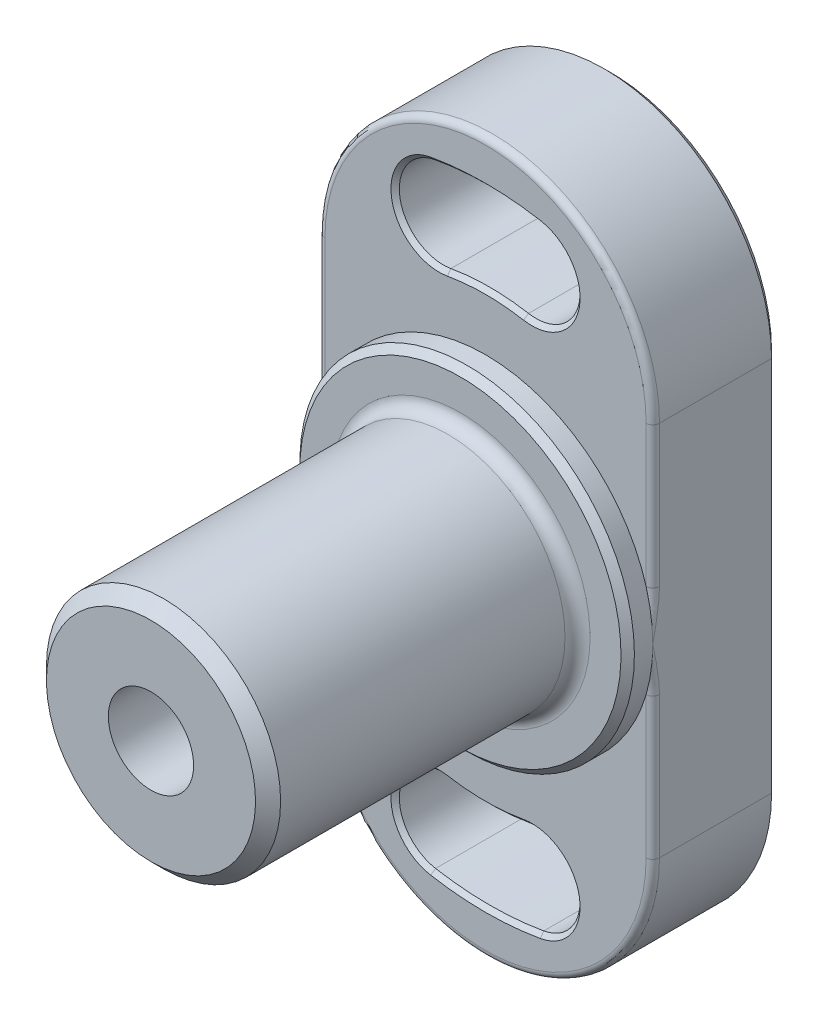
ISO-10303-21;
HEADER;
FILE_DESCRIPTION(('STEP AP214'),'2;1');
FILE_NAME('part.step','',(''),(''),'','','');
FILE_SCHEMA(('AUTOMOTIVE_DESIGN { 1 0 10303 214 1 1 1 1 }'));
ENDSEC;
DATA;
#1=APPLICATION_CONTEXT('core data for automotive mechanical design processes');
#2=APPLICATION_PROTOCOL_DEFINITION('international standard','automotive_design',2000,#1);
#3=PRODUCT_CONTEXT('',#1,'mechanical');
#4=PRODUCT('Part','Part','',(#3));
#5=PRODUCT_RELATED_PRODUCT_CATEGORY('part','',(#4));
#6=PRODUCT_DEFINITION_FORMATION('','',#4);
#7=PRODUCT_DEFINITION_CONTEXT('part definition',#1,'design');
#8=PRODUCT_DEFINITION('design','',#6,#7);
#9=PRODUCT_DEFINITION_SHAPE('','',#8);
#10=(LENGTH_UNIT() NAMED_UNIT(*) SI_UNIT(.MILLI.,.METRE.));
#11=(NAMED_UNIT(*) PLANE_ANGLE_UNIT() SI_UNIT($,.RADIAN.));
#12=(NAMED_UNIT(*) SI_UNIT($,.STERADIAN.) SOLID_ANGLE_UNIT());
#13=UNCERTAINTY_MEASURE_WITH_UNIT(LENGTH_MEASURE(1.E-05),#10,'distance_accuracy_value','');
#14=(GEOMETRIC_REPRESENTATION_CONTEXT(3) GLOBAL_UNCERTAINTY_ASSIGNED_CONTEXT((#13)) GLOBAL_UNIT_ASSIGNED_CONTEXT((#10,
#11,#12)) REPRESENTATION_CONTEXT('',''));
#15=CARTESIAN_POINT('',(0.,0.,0.));
#16=DIRECTION('',(0.,0.,1.));
#17=DIRECTION('',(1.,0.,0.));
#18=AXIS2_PLACEMENT_3D('',#15,#16,#17);
#19=CARTESIAN_POINT('',(14.,0.,55.));
#20=DIRECTION('',(0.,0.,1.));
#21=DIRECTION('',(0.,-1.,0.));
#22=AXIS2_PLACEMENT_3D('',#19,#20,#21);
#23=PLANE('',#22);
#24=CARTESIAN_POINT('',(0.,0.,55.));
#25=DIRECTION('',(0.,0.,1.));
#26=DIRECTION('',(0.,-1.,0.));
#27=AXIS2_PLACEMENT_3D('',#24,#25,#26);
#28=CIRCLE('',#27,12.5);
#29=CARTESIAN_POINT('',(0.,-12.5,55.));
#30=VERTEX_POINT('',#29);
#31=EDGE_CURVE('E9',#30,#30,#28,.T.);
#32=ORIENTED_EDGE('',*,*,#31,.T.);
#33=EDGE_LOOP('',(#32));
#34=FACE_BOUND('',#33,.T.);
#35=CARTESIAN_POINT('',(0.,0.,55.));
#36=DIRECTION('',(0.,0.,-1.));
#37=DIRECTION('',(0.,1.,0.));
#38=AXIS2_PLACEMENT_3D('',#35,#36,#37);
#39=CIRCLE('',#38,5.1);
#40=CARTESIAN_POINT('',(0.,5.1,55.));
#41=VERTEX_POINT('',#40);
#42=EDGE_CURVE('E235',#41,#41,#39,.T.);
#43=ORIENTED_EDGE('',*,*,#42,.T.);
#44=EDGE_LOOP('',(#43));
#45=FACE_BOUND('',#44,.T.);
#46=ADVANCED_FACE('F14',(#34,#45),#23,.T.);
#47=CARTESIAN_POINT('',(0.,0.,0.));
#48=DIRECTION('',(0.,0.,-1.));
#49=DIRECTION('',(0.,1.,0.));
#50=AXIS2_PLACEMENT_3D('',#47,#48,#49);
#51=CYLINDRICAL_SURFACE('',#50,14.);
#52=CARTESIAN_POINT('',(0.,0.,53.5));
#53=DIRECTION('',(0.,0.,1.));
#54=DIRECTION('',(0.,-1.,0.));
#55=AXIS2_PLACEMENT_3D('',#52,#53,#54);
#56=CIRCLE('',#55,14.);
#57=CARTESIAN_POINT('',(0.,-14.,53.5));
#58=VERTEX_POINT('',#57);
#59=EDGE_CURVE('E22',#58,#58,#56,.F.);
#60=ORIENTED_EDGE('',*,*,#59,.T.);
#61=EDGE_LOOP('',(#60));
#62=FACE_BOUND('',#61,.T.);
#63=CARTESIAN_POINT('',(0.,0.,19.5));
#64=DIRECTION('',(0.,0.,1.));
#65=DIRECTION('',(0.,-1.,0.));
#66=AXIS2_PLACEMENT_3D('',#63,#64,#65);
#67=CIRCLE('',#66,14.);
#68=CARTESIAN_POINT('',(0.,-14.,19.5));
#69=VERTEX_POINT('',#68);
#70=EDGE_CURVE('E627',#69,#69,#67,.T.);
#71=ORIENTED_EDGE('',*,*,#70,.T.);
#72=EDGE_LOOP('',(#71));
#73=FACE_BOUND('',#72,.T.);
#74=ADVANCED_FACE('F431',(#62,#73),#51,.T.);
#75=CARTESIAN_POINT('',(0.,0.,0.));
#76=DIRECTION('',(0.,0.,-1.));
#77=DIRECTION('',(0.,1.,0.));
#78=AXIS2_PLACEMENT_3D('',#75,#76,#77);
#79=CYLINDRICAL_SURFACE('',#78,5.1);
#80=ORIENTED_EDGE('',*,*,#42,.F.);
#81=EDGE_LOOP('',(#80));
#82=FACE_BOUND('',#81,.T.);
#83=CARTESIAN_POINT('',(0.,0.,15.));
#84=DIRECTION('',(0.,0.,-1.));
#85=DIRECTION('',(0.,1.,0.));
#86=AXIS2_PLACEMENT_3D('',#83,#84,#85);
#87=CIRCLE('',#86,5.1);
#88=CARTESIAN_POINT('',(0.,5.1,15.));
#89=VERTEX_POINT('',#88);
#90=EDGE_CURVE('E636',#89,#89,#87,.T.);
#91=ORIENTED_EDGE('',*,*,#90,.T.);
#92=EDGE_LOOP('',(#91));
#93=FACE_BOUND('',#92,.T.);
#94=ADVANCED_FACE('F438',(#82,#93),#79,.F.);
#95=CARTESIAN_POINT('',(0.,0.,15.));
#96=DIRECTION('',(0.,0.,-1.));
#97=DIRECTION('',(0.,1.,0.));
#98=AXIS2_PLACEMENT_3D('',#95,#96,#97);
#99=PLANE('',#98);
#100=ORIENTED_EDGE('',*,*,#90,.F.);
#101=EDGE_LOOP('',(#100));
#102=FACE_BOUND('',#101,.T.);
#103=ADVANCED_FACE('F715',(#102),#99,.F.);
#104=CARTESIAN_POINT('',(14.,0.,18.));
#105=DIRECTION('',(0.,0.,1.));
#106=DIRECTION('',(0.,-1.,0.));
#107=AXIS2_PLACEMENT_3D('',#104,#105,#106);
#108=PLANE('',#107);
#109=CARTESIAN_POINT('',(0.,0.,18.));
#110=DIRECTION('',(0.,0.,1.));
#111=DIRECTION('',(0.,-1.,0.));
#112=AXIS2_PLACEMENT_3D('',#109,#110,#111);
#113=CIRCLE('',#112,19.2);
#114=CARTESIAN_POINT('',(0.,-19.2,18.));
#115=VERTEX_POINT('',#114);
#116=EDGE_CURVE('E700',#115,#115,#113,.T.);
#117=ORIENTED_EDGE('',*,*,#116,.T.);
#118=EDGE_LOOP('',(#117));
#119=FACE_BOUND('',#118,.T.);
#120=CARTESIAN_POINT('',(0.,0.,18.));
#121=DIRECTION('',(0.,0.,1.));
#122=DIRECTION('',(0.,-1.,0.));
#123=AXIS2_PLACEMENT_3D('',#120,#121,#122);
#124=CIRCLE('',#123,15.5);
#125=CARTESIAN_POINT('',(0.,-15.5,18.));
#126=VERTEX_POINT('',#125);
#127=EDGE_CURVE('E624',#126,#126,#124,.F.);
#128=ORIENTED_EDGE('',*,*,#127,.T.);
#129=EDGE_LOOP('',(#128));
#130=FACE_BOUND('',#129,.T.);
#131=ADVANCED_FACE('F713',(#119,#130),#108,.T.);
#132=CARTESIAN_POINT('',(0.,0.,0.));
#133=DIRECTION('',(0.,0.,-1.));
#134=DIRECTION('',(0.,1.,0.));
#135=AXIS2_PLACEMENT_3D('',#132,#133,#134);
#136=CYLINDRICAL_SURFACE('',#135,20.);
#137=CARTESIAN_POINT('',(0.,0.,17.2));
#138=DIRECTION('',(0.,0.,1.));
#139=DIRECTION('',(0.,-1.,0.));
#140=AXIS2_PLACEMENT_3D('',#137,#138,#139);
#141=CIRCLE('',#140,20.);
#142=CARTESIAN_POINT('',(0.,-20.,17.2));
#143=VERTEX_POINT('',#142);
#144=EDGE_CURVE('E697',#143,#143,#141,.F.);
#145=ORIENTED_EDGE('',*,*,#144,.T.);
#146=EDGE_LOOP('',(#145));
#147=FACE_BOUND('',#146,.T.);
#148=CARTESIAN_POINT('',(0.,0.,15.));
#149=DIRECTION('',(0.,0.,-1.));
#150=DIRECTION('',(0.,1.,0.));
#151=AXIS2_PLACEMENT_3D('',#148,#149,#150);
#152=CIRCLE('',#151,20.);
#153=CARTESIAN_POINT('',(20.,0.,15.));
#154=VERTEX_POINT('',#153);
#155=CARTESIAN_POINT('',(19.2,-5.6,15.));
#156=VERTEX_POINT('',#155);
#157=EDGE_CURVE('E225',#154,#156,#152,.T.);
#158=ORIENTED_EDGE('',*,*,#157,.F.);
#159=CARTESIAN_POINT('',(19.2,5.6,15.));
#160=VERTEX_POINT('',#159);
#161=EDGE_CURVE('E228',#160,#154,#152,.T.);
#162=ORIENTED_EDGE('',*,*,#161,.F.);
#163=CARTESIAN_POINT('',(-19.2,5.6,15.));
#164=VERTEX_POINT('',#163);
#165=EDGE_CURVE('E242',#164,#160,#152,.T.);
#166=ORIENTED_EDGE('',*,*,#165,.F.);
#167=CARTESIAN_POINT('',(-20.,0.,15.));
#168=VERTEX_POINT('',#167);
#169=EDGE_CURVE('E238',#168,#164,#152,.T.);
#170=ORIENTED_EDGE('',*,*,#169,.F.);
#171=CARTESIAN_POINT('',(-19.2,-5.6,15.));
#172=VERTEX_POINT('',#171);
#173=EDGE_CURVE('E237',#172,#168,#152,.T.);
#174=ORIENTED_EDGE('',*,*,#173,.F.);
#175=EDGE_CURVE('E231',#156,#172,#152,.T.);
#176=ORIENTED_EDGE('',*,*,#175,.F.);
#177=EDGE_LOOP('',(#158,#162,#166,#170,#174,#176));
#178=FACE_BOUND('',#177,.T.);
#179=ADVANCED_FACE('F226',(#147,#178),#136,.T.);
#180=CARTESIAN_POINT('',(0.,22.5,0.));
#181=DIRECTION('',(0.,0.,1.));
#182=DIRECTION('',(0.,-1.,0.));
#183=AXIS2_PLACEMENT_3D('',#180,#181,#182);
#184=PLANE('',#183);
#185=CARTESIAN_POINT('',(5.55674168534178,31.5138480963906,0.));
#186=DIRECTION('',(0.,0.,1.));
#187=DIRECTION('',(0.,-1.,0.));
#188=AXIS2_PLACEMENT_3D('',#185,#186,#187);
#189=CIRCLE('',#188,5.75);
#190=CARTESIAN_POINT('',(4.55826466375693,25.8512035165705,0.));
#191=VERTEX_POINT('',#190);
#192=CARTESIAN_POINT('',(6.55521870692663,37.1764926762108,0.));
#193=VERTEX_POINT('',#192);
#194=EDGE_CURVE('E37',#191,#193,#189,.T.);
#195=ORIENTED_EDGE('',*,*,#194,.T.);
#196=CARTESIAN_POINT('',(0.,0.,0.));
#197=DIRECTION('',(0.,0.,1.));
#198=DIRECTION('',(0.,-1.,0.));
#199=AXIS2_PLACEMENT_3D('',#196,#197,#198);
#200=CIRCLE('',#199,37.75);
#201=CARTESIAN_POINT('',(-6.55521870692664,37.1764926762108,0.));
#202=VERTEX_POINT('',#201);
#203=EDGE_CURVE('E701',#193,#202,#200,.T.);
#204=ORIENTED_EDGE('',*,*,#203,.T.);
#205=CARTESIAN_POINT('',(-5.55674168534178,31.5138480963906,0.));
#206=DIRECTION('',(0.,0.,1.));
#207=DIRECTION('',(0.,-1.,0.));
#208=AXIS2_PLACEMENT_3D('',#205,#206,#207);
#209=CIRCLE('',#208,5.75);
#210=CARTESIAN_POINT('',(-4.55826466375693,25.8512035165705,0.));
#211=VERTEX_POINT('',#210);
#212=EDGE_CURVE('E674',#202,#211,#209,.T.);
#213=ORIENTED_EDGE('',*,*,#212,.T.);
#214=CARTESIAN_POINT('',(0.,0.,0.));
#215=DIRECTION('',(0.,0.,1.));
#216=DIRECTION('',(0.,-1.,0.));
#217=AXIS2_PLACEMENT_3D('',#214,#215,#216);
#218=CIRCLE('',#217,26.25);
#219=EDGE_CURVE('E1133',#211,#191,#218,.F.);
#220=ORIENTED_EDGE('',*,*,#219,.T.);
#221=EDGE_LOOP('',(#195,#204,#213,#220));
#222=FACE_BOUND('',#221,.T.);
#223=CARTESIAN_POINT('',(-5.55674168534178,-31.5138480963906,0.));
#224=DIRECTION('',(0.,0.,1.));
#225=DIRECTION('',(0.,-1.,0.));
#226=AXIS2_PLACEMENT_3D('',#223,#224,#225);
#227=CIRCLE('',#226,5.75);
#228=CARTESIAN_POINT('',(-4.55826466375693,-25.8512035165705,0.));
#229=VERTEX_POINT('',#228);
#230=CARTESIAN_POINT('',(-6.55521870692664,-37.1764926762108,0.));
#231=VERTEX_POINT('',#230);
#232=EDGE_CURVE('E1126',#229,#231,#227,.T.);
#233=ORIENTED_EDGE('',*,*,#232,.T.);
#234=CARTESIAN_POINT('',(0.,0.,0.));
#235=DIRECTION('',(0.,0.,1.));
#236=DIRECTION('',(0.,-1.,0.));
#237=AXIS2_PLACEMENT_3D('',#234,#235,#236);
#238=CIRCLE('',#237,37.75);
#239=CARTESIAN_POINT('',(6.55521870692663,-37.1764926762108,0.));
#240=VERTEX_POINT('',#239);
#241=EDGE_CURVE('E1130',#231,#240,#238,.T.);
#242=ORIENTED_EDGE('',*,*,#241,.T.);
#243=CARTESIAN_POINT('',(5.55674168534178,-31.5138480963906,0.));
#244=DIRECTION('',(0.,0.,1.));
#245=DIRECTION('',(0.,-1.,0.));
#246=AXIS2_PLACEMENT_3D('',#243,#244,#245);
#247=CIRCLE('',#246,5.75);
#248=CARTESIAN_POINT('',(4.55826466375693,-25.8512035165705,0.));
#249=VERTEX_POINT('',#248);
#250=EDGE_CURVE('E1128',#240,#249,#247,.T.);
#251=ORIENTED_EDGE('',*,*,#250,.T.);
#252=CARTESIAN_POINT('',(0.,0.,0.));
#253=DIRECTION('',(0.,0.,1.));
#254=DIRECTION('',(0.,-1.,0.));
#255=AXIS2_PLACEMENT_3D('',#252,#253,#254);
#256=CIRCLE('',#255,26.25);
#257=EDGE_CURVE('E1124',#249,#229,#256,.F.);
#258=ORIENTED_EDGE('',*,*,#257,.T.);
#259=EDGE_LOOP('',(#233,#242,#251,#258));
#260=FACE_BOUND('',#259,.T.);
#261=CARTESIAN_POINT('',(0.,22.5,0.));
#262=DIRECTION('',(0.,0.,1.));
#263=DIRECTION('',(0.,-1.,0.));
#264=AXIS2_PLACEMENT_3D('',#261,#262,#263);
#265=CIRCLE('',#264,19.2);
#266=CARTESIAN_POINT('',(-19.2,22.5,0.));
#267=VERTEX_POINT('',#266);
#268=CARTESIAN_POINT('',(19.2,22.5,0.));
#269=VERTEX_POINT('',#268);
#270=EDGE_CURVE('E1068',#267,#269,#265,.F.);
#271=ORIENTED_EDGE('',*,*,#270,.T.);
#272=DIRECTION('',(0.,-1.,0.));
#273=VECTOR('',#272,1.);
#274=CARTESIAN_POINT('',(19.2,22.5,0.));
#275=LINE('',#274,#273);
#276=CARTESIAN_POINT('',(19.2,-22.5,0.));
#277=VERTEX_POINT('',#276);
#278=EDGE_CURVE('E1185',#269,#277,#275,.T.);
#279=ORIENTED_EDGE('',*,*,#278,.T.);
#280=CARTESIAN_POINT('',(0.,-22.5,0.));
#281=DIRECTION('',(0.,0.,1.));
#282=DIRECTION('',(0.,-1.,0.));
#283=AXIS2_PLACEMENT_3D('',#280,#281,#282);
#284=CIRCLE('',#283,19.2);
#285=CARTESIAN_POINT('',(-19.2,-22.5,0.));
#286=VERTEX_POINT('',#285);
#287=EDGE_CURVE('E1186',#277,#286,#284,.F.);
#288=ORIENTED_EDGE('',*,*,#287,.T.);
#289=DIRECTION('',(0.,1.,0.));
#290=VECTOR('',#289,1.);
#291=CARTESIAN_POINT('',(-19.2,22.5,0.));
#292=LINE('',#291,#290);
#293=EDGE_CURVE('E576',#286,#267,#292,.T.);
#294=ORIENTED_EDGE('',*,*,#293,.T.);
#295=EDGE_LOOP('',(#271,#279,#288,#294));
#296=FACE_BOUND('',#295,.T.);
#297=ADVANCED_FACE('F272',(#222,#260,#296),#184,.F.);
#298=CARTESIAN_POINT('',(0.,0.,15.));
#299=DIRECTION('',(0.,0.,-1.));
#300=DIRECTION('',(0.,1.,0.));
#301=AXIS2_PLACEMENT_3D('',#298,#299,#300);
#302=CYLINDRICAL_SURFACE('',#301,26.75);
#303=DIRECTION('',(0.,0.,-1.));
#304=VECTOR('',#303,1.);
#305=CARTESIAN_POINT('',(-4.64508875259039,26.3436073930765,15.));
#306=LINE('',#305,#304);
#307=CARTESIAN_POINT('',(-4.64508875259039,26.3436073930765,14.5));
#308=VERTEX_POINT('',#307);
#309=CARTESIAN_POINT('',(-4.64508875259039,26.3436073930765,0.5));
#310=VERTEX_POINT('',#309);
#311=EDGE_CURVE('E657',#308,#310,#306,.T.);
#312=ORIENTED_EDGE('',*,*,#311,.F.);
#313=CARTESIAN_POINT('',(0.,0.,14.5));
#314=DIRECTION('',(0.,0.,1.));
#315=DIRECTION('',(0.,-1.,0.));
#316=AXIS2_PLACEMENT_3D('',#313,#314,#315);
#317=CIRCLE('',#316,26.75);
#318=CARTESIAN_POINT('',(4.6450887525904,26.3436073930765,14.5));
#319=VERTEX_POINT('',#318);
#320=EDGE_CURVE('E1095',#308,#319,#317,.F.);
#321=ORIENTED_EDGE('',*,*,#320,.T.);
#322=DIRECTION('',(0.,0.,-1.));
#323=VECTOR('',#322,1.);
#324=CARTESIAN_POINT('',(4.6450887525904,26.3436073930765,15.));
#325=LINE('',#324,#323);
#326=CARTESIAN_POINT('',(4.6450887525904,26.3436073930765,0.5));
#327=VERTEX_POINT('',#326);
#328=EDGE_CURVE('E654',#319,#327,#325,.T.);
#329=ORIENTED_EDGE('',*,*,#328,.T.);
#330=CARTESIAN_POINT('',(0.,0.,0.5));
#331=DIRECTION('',(0.,0.,1.));
#332=DIRECTION('',(0.,-1.,0.));
#333=AXIS2_PLACEMENT_3D('',#330,#331,#332);
#334=CIRCLE('',#333,26.75);
#335=EDGE_CURVE('E1093',#327,#310,#334,.T.);
#336=ORIENTED_EDGE('',*,*,#335,.T.);
#337=EDGE_LOOP('',(#312,#321,#329,#336));
#338=FACE_BOUND('',#337,.T.);
#339=ADVANCED_FACE('F464',(#338),#302,.T.);
#340=CARTESIAN_POINT('',(5.55674168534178,31.5138480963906,15.));
#341=DIRECTION('',(0.,0.,-1.));
#342=DIRECTION('',(0.,1.,0.));
#343=AXIS2_PLACEMENT_3D('',#340,#341,#342);
#344=CYLINDRICAL_SURFACE('',#343,5.25);
#345=ORIENTED_EDGE('',*,*,#328,.F.);
#346=CARTESIAN_POINT('',(5.55674168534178,31.5138480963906,14.5));
#347=DIRECTION('',(0.,0.,1.));
#348=DIRECTION('',(0.,-1.,0.));
#349=AXIS2_PLACEMENT_3D('',#346,#347,#348);
#350=CIRCLE('',#349,5.25);
#351=CARTESIAN_POINT('',(6.46839461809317,36.6840887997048,14.5));
#352=VERTEX_POINT('',#351);
#353=EDGE_CURVE('E1091',#319,#352,#350,.T.);
#354=ORIENTED_EDGE('',*,*,#353,.T.);
#355=DIRECTION('',(0.,0.,-1.));
#356=VECTOR('',#355,1.);
#357=CARTESIAN_POINT('',(6.46839461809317,36.6840887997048,15.));
#358=LINE('',#357,#356);
#359=CARTESIAN_POINT('',(6.46839461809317,36.6840887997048,0.5));
#360=VERTEX_POINT('',#359);
#361=EDGE_CURVE('E651',#352,#360,#358,.T.);
#362=ORIENTED_EDGE('',*,*,#361,.T.);
#363=CARTESIAN_POINT('',(5.55674168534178,31.5138480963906,0.5));
#364=DIRECTION('',(0.,0.,1.));
#365=DIRECTION('',(0.,-1.,0.));
#366=AXIS2_PLACEMENT_3D('',#363,#364,#365);
#367=CIRCLE('',#366,5.25);
#368=EDGE_CURVE('E1089',#360,#327,#367,.F.);
#369=ORIENTED_EDGE('',*,*,#368,.T.);
#370=EDGE_LOOP('',(#345,#354,#362,#369));
#371=FACE_BOUND('',#370,.T.);
#372=ADVANCED_FACE('F460',(#371),#344,.F.);
#373=CARTESIAN_POINT('',(0.,0.,15.));
#374=DIRECTION('',(0.,0.,-1.));
#375=DIRECTION('',(0.,1.,0.));
#376=AXIS2_PLACEMENT_3D('',#373,#374,#375);
#377=CYLINDRICAL_SURFACE('',#376,37.25);
#378=ORIENTED_EDGE('',*,*,#361,.F.);
#379=CARTESIAN_POINT('',(0.,0.,14.5));
#380=DIRECTION('',(0.,0.,1.));
#381=DIRECTION('',(0.,-1.,0.));
#382=AXIS2_PLACEMENT_3D('',#379,#380,#381);
#383=CIRCLE('',#382,37.25);
#384=CARTESIAN_POINT('',(-6.46839461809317,36.6840887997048,14.5));
#385=VERTEX_POINT('',#384);
#386=EDGE_CURVE('E666',#352,#385,#383,.T.);
#387=ORIENTED_EDGE('',*,*,#386,.T.);
#388=DIRECTION('',(0.,0.,-1.));
#389=VECTOR('',#388,1.);
#390=CARTESIAN_POINT('',(-6.46839461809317,36.6840887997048,15.));
#391=LINE('',#390,#389);
#392=CARTESIAN_POINT('',(-6.46839461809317,36.6840887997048,0.5));
#393=VERTEX_POINT('',#392);
#394=EDGE_CURVE('E618',#385,#393,#391,.T.);
#395=ORIENTED_EDGE('',*,*,#394,.T.);
#396=CARTESIAN_POINT('',(0.,0.,0.5));
#397=DIRECTION('',(0.,0.,1.));
#398=DIRECTION('',(0.,-1.,0.));
#399=AXIS2_PLACEMENT_3D('',#396,#397,#398);
#400=CIRCLE('',#399,37.25);
#401=EDGE_CURVE('E664',#393,#360,#400,.F.);
#402=ORIENTED_EDGE('',*,*,#401,.T.);
#403=EDGE_LOOP('',(#378,#387,#395,#402));
#404=FACE_BOUND('',#403,.T.);
#405=ADVANCED_FACE('F463',(#404),#377,.F.);
#406=CARTESIAN_POINT('',(-5.55674168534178,31.5138480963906,15.));
#407=DIRECTION('',(0.,0.,-1.));
#408=DIRECTION('',(0.,1.,0.));
#409=AXIS2_PLACEMENT_3D('',#406,#407,#408);
#410=CYLINDRICAL_SURFACE('',#409,5.25);
#411=ORIENTED_EDGE('',*,*,#394,.F.);
#412=CARTESIAN_POINT('',(-5.55674168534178,31.5138480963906,14.5));
#413=DIRECTION('',(0.,0.,1.));
#414=DIRECTION('',(0.,-1.,0.));
#415=AXIS2_PLACEMENT_3D('',#412,#413,#414);
#416=CIRCLE('',#415,5.25);
#417=EDGE_CURVE('E1087',#385,#308,#416,.T.);
#418=ORIENTED_EDGE('',*,*,#417,.T.);
#419=ORIENTED_EDGE('',*,*,#311,.T.);
#420=CARTESIAN_POINT('',(-5.55674168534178,31.5138480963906,0.5));
#421=DIRECTION('',(0.,0.,1.));
#422=DIRECTION('',(0.,-1.,0.));
#423=AXIS2_PLACEMENT_3D('',#420,#421,#422);
#424=CIRCLE('',#423,5.25);
#425=EDGE_CURVE('E673',#310,#393,#424,.F.);
#426=ORIENTED_EDGE('',*,*,#425,.T.);
#427=EDGE_LOOP('',(#411,#418,#419,#426));
#428=FACE_BOUND('',#427,.T.);
#429=ADVANCED_FACE('F469',(#428),#410,.F.);
#430=CARTESIAN_POINT('',(0.,22.5,15.));
#431=DIRECTION('',(0.,0.,-1.));
#432=DIRECTION('',(0.,1.,0.));
#433=AXIS2_PLACEMENT_3D('',#430,#431,#432);
#434=CYLINDRICAL_SURFACE('',#433,20.);
#435=DIRECTION('',(0.,0.,-1.));
#436=VECTOR('',#435,1.);
#437=CARTESIAN_POINT('',(20.,22.5,15.));
#438=LINE('',#437,#436);
#439=CARTESIAN_POINT('',(20.,22.5,14.2));
#440=VERTEX_POINT('',#439);
#441=CARTESIAN_POINT('',(20.,22.5,0.799999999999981));
#442=VERTEX_POINT('',#441);
#443=EDGE_CURVE('E614',#440,#442,#438,.T.);
#444=ORIENTED_EDGE('',*,*,#443,.T.);
#445=CARTESIAN_POINT('',(0.,22.5,0.799999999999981));
#446=DIRECTION('',(0.,0.,1.));
#447=DIRECTION('',(0.,-1.,0.));
#448=AXIS2_PLACEMENT_3D('',#445,#446,#447);
#449=CIRCLE('',#448,20.);
#450=CARTESIAN_POINT('',(-20.,22.5,0.799999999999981));
#451=VERTEX_POINT('',#450);
#452=EDGE_CURVE('E1067',#442,#451,#449,.T.);
#453=ORIENTED_EDGE('',*,*,#452,.T.);
#454=DIRECTION('',(0.,0.,-1.));
#455=VECTOR('',#454,1.);
#456=CARTESIAN_POINT('',(-20.,22.5,15.));
#457=LINE('',#456,#455);
#458=CARTESIAN_POINT('',(-20.,22.5,14.2));
#459=VERTEX_POINT('',#458);
#460=EDGE_CURVE('E616',#459,#451,#457,.T.);
#461=ORIENTED_EDGE('',*,*,#460,.F.);
#462=CARTESIAN_POINT('',(0.,22.5,14.2));
#463=DIRECTION('',(0.,0.,1.));
#464=DIRECTION('',(0.,-1.,0.));
#465=AXIS2_PLACEMENT_3D('',#462,#463,#464);
#466=CIRCLE('',#465,20.);
#467=EDGE_CURVE('E530',#459,#440,#466,.F.);
#468=ORIENTED_EDGE('',*,*,#467,.T.);
#469=EDGE_LOOP('',(#444,#453,#461,#468));
#470=FACE_BOUND('',#469,.T.);
#471=ADVANCED_FACE('F452',(#470),#434,.T.);
#472=CARTESIAN_POINT('',(-5.55674168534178,-31.5138480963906,15.));
#473=DIRECTION('',(0.,0.,-1.));
#474=DIRECTION('',(0.,1.,0.));
#475=AXIS2_PLACEMENT_3D('',#472,#473,#474);
#476=CYLINDRICAL_SURFACE('',#475,5.25);
#477=DIRECTION('',(0.,0.,-1.));
#478=VECTOR('',#477,1.);
#479=CARTESIAN_POINT('',(-4.64508875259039,-26.3436073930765,15.));
#480=LINE('',#479,#478);
#481=CARTESIAN_POINT('',(-4.64508875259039,-26.3436073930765,14.5));
#482=VERTEX_POINT('',#481);
#483=CARTESIAN_POINT('',(-4.64508875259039,-26.3436073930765,0.5));
#484=VERTEX_POINT('',#483);
#485=EDGE_CURVE('E645',#482,#484,#480,.T.);
#486=ORIENTED_EDGE('',*,*,#485,.F.);
#487=CARTESIAN_POINT('',(-5.55674168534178,-31.5138480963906,14.5));
#488=DIRECTION('',(0.,0.,1.));
#489=DIRECTION('',(0.,-1.,0.));
#490=AXIS2_PLACEMENT_3D('',#487,#488,#489);
#491=CIRCLE('',#490,5.25);
#492=CARTESIAN_POINT('',(-6.46839461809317,-36.6840887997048,14.5));
#493=VERTEX_POINT('',#492);
#494=EDGE_CURVE('E1118',#482,#493,#491,.T.);
#495=ORIENTED_EDGE('',*,*,#494,.T.);
#496=DIRECTION('',(0.,0.,-1.));
#497=VECTOR('',#496,1.);
#498=CARTESIAN_POINT('',(-6.46839461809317,-36.6840887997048,15.));
#499=LINE('',#498,#497);
#500=CARTESIAN_POINT('',(-6.46839461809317,-36.6840887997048,0.5));
#501=VERTEX_POINT('',#500);
#502=EDGE_CURVE('E642',#493,#501,#499,.T.);
#503=ORIENTED_EDGE('',*,*,#502,.T.);
#504=CARTESIAN_POINT('',(-5.55674168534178,-31.5138480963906,0.5));
#505=DIRECTION('',(0.,0.,1.));
#506=DIRECTION('',(0.,-1.,0.));
#507=AXIS2_PLACEMENT_3D('',#504,#505,#506);
#508=CIRCLE('',#507,5.25);
#509=EDGE_CURVE('E1116',#501,#484,#508,.F.);
#510=ORIENTED_EDGE('',*,*,#509,.T.);
#511=EDGE_LOOP('',(#486,#495,#503,#510));
#512=FACE_BOUND('',#511,.T.);
#513=ADVANCED_FACE('F448',(#512),#476,.F.);
#514=CARTESIAN_POINT('',(0.,0.,15.));
#515=DIRECTION('',(0.,0.,-1.));
#516=DIRECTION('',(0.,1.,0.));
#517=AXIS2_PLACEMENT_3D('',#514,#515,#516);
#518=CYLINDRICAL_SURFACE('',#517,37.25);
#519=ORIENTED_EDGE('',*,*,#502,.F.);
#520=CARTESIAN_POINT('',(0.,0.,14.5));
#521=DIRECTION('',(0.,0.,1.));
#522=DIRECTION('',(0.,-1.,0.));
#523=AXIS2_PLACEMENT_3D('',#520,#521,#522);
#524=CIRCLE('',#523,37.25);
#525=CARTESIAN_POINT('',(6.46839461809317,-36.6840887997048,14.5));
#526=VERTEX_POINT('',#525);
#527=EDGE_CURVE('E1100',#493,#526,#524,.T.);
#528=ORIENTED_EDGE('',*,*,#527,.T.);
#529=DIRECTION('',(0.,0.,-1.));
#530=VECTOR('',#529,1.);
#531=CARTESIAN_POINT('',(6.46839461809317,-36.6840887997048,15.));
#532=LINE('',#531,#530);
#533=CARTESIAN_POINT('',(6.46839461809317,-36.6840887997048,0.5));
#534=VERTEX_POINT('',#533);
#535=EDGE_CURVE('E639',#526,#534,#532,.T.);
#536=ORIENTED_EDGE('',*,*,#535,.T.);
#537=CARTESIAN_POINT('',(0.,0.,0.5));
#538=DIRECTION('',(0.,0.,1.));
#539=DIRECTION('',(0.,-1.,0.));
#540=AXIS2_PLACEMENT_3D('',#537,#538,#539);
#541=CIRCLE('',#540,37.25);
#542=EDGE_CURVE('E1097',#534,#501,#541,.F.);
#543=ORIENTED_EDGE('',*,*,#542,.T.);
#544=EDGE_LOOP('',(#519,#528,#536,#543));
#545=FACE_BOUND('',#544,.T.);
#546=ADVANCED_FACE('F444',(#545),#518,.F.);
#547=CARTESIAN_POINT('',(5.55674168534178,-31.5138480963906,15.));
#548=DIRECTION('',(0.,0.,-1.));
#549=DIRECTION('',(0.,1.,0.));
#550=AXIS2_PLACEMENT_3D('',#547,#548,#549);
#551=CYLINDRICAL_SURFACE('',#550,5.25);
#552=ORIENTED_EDGE('',*,*,#535,.F.);
#553=CARTESIAN_POINT('',(5.55674168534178,-31.5138480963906,14.5));
#554=DIRECTION('',(0.,0.,1.));
#555=DIRECTION('',(0.,-1.,0.));
#556=AXIS2_PLACEMENT_3D('',#553,#554,#555);
#557=CIRCLE('',#556,5.25);
#558=CARTESIAN_POINT('',(4.6450887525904,-26.3436073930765,14.5));
#559=VERTEX_POINT('',#558);
#560=EDGE_CURVE('E1114',#526,#559,#557,.T.);
#561=ORIENTED_EDGE('',*,*,#560,.T.);
#562=DIRECTION('',(0.,0.,-1.));
#563=VECTOR('',#562,1.);
#564=CARTESIAN_POINT('',(4.6450887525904,-26.3436073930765,15.));
#565=LINE('',#564,#563);
#566=CARTESIAN_POINT('',(4.6450887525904,-26.3436073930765,0.5));
#567=VERTEX_POINT('',#566);
#568=EDGE_CURVE('E648',#559,#567,#565,.T.);
#569=ORIENTED_EDGE('',*,*,#568,.T.);
#570=CARTESIAN_POINT('',(5.55674168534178,-31.5138480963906,0.5));
#571=DIRECTION('',(0.,0.,1.));
#572=DIRECTION('',(0.,-1.,0.));
#573=AXIS2_PLACEMENT_3D('',#570,#571,#572);
#574=CIRCLE('',#573,5.25);
#575=EDGE_CURVE('E1112',#567,#534,#574,.F.);
#576=ORIENTED_EDGE('',*,*,#575,.T.);
#577=EDGE_LOOP('',(#552,#561,#569,#576));
#578=FACE_BOUND('',#577,.T.);
#579=ADVANCED_FACE('F447',(#578),#551,.F.);
#580=CARTESIAN_POINT('',(0.,0.,15.));
#581=DIRECTION('',(0.,0.,-1.));
#582=DIRECTION('',(0.,1.,0.));
#583=AXIS2_PLACEMENT_3D('',#580,#581,#582);
#584=CYLINDRICAL_SURFACE('',#583,26.75);
#585=ORIENTED_EDGE('',*,*,#568,.F.);
#586=CARTESIAN_POINT('',(0.,0.,14.5));
#587=DIRECTION('',(0.,0.,1.));
#588=DIRECTION('',(0.,-1.,0.));
#589=AXIS2_PLACEMENT_3D('',#586,#587,#588);
#590=CIRCLE('',#589,26.75);
#591=EDGE_CURVE('E1122',#559,#482,#590,.F.);
#592=ORIENTED_EDGE('',*,*,#591,.T.);
#593=ORIENTED_EDGE('',*,*,#485,.T.);
#594=CARTESIAN_POINT('',(0.,0.,0.5));
#595=DIRECTION('',(0.,0.,1.));
#596=DIRECTION('',(0.,-1.,0.));
#597=AXIS2_PLACEMENT_3D('',#594,#595,#596);
#598=CIRCLE('',#597,26.75);
#599=EDGE_CURVE('E1120',#484,#567,#598,.T.);
#600=ORIENTED_EDGE('',*,*,#599,.T.);
#601=EDGE_LOOP('',(#585,#592,#593,#600));
#602=FACE_BOUND('',#601,.T.);
#603=ADVANCED_FACE('F271',(#602),#584,.T.);
#604=CARTESIAN_POINT('',(20.,22.5,15.));
#605=DIRECTION('',(-1.,0.,0.));
#606=DIRECTION('',(0.,-1.,0.));
#607=AXIS2_PLACEMENT_3D('',#604,#605,#606);
#608=PLANE('',#607);
#609=DIRECTION('',(0.,0.,-1.));
#610=VECTOR('',#609,1.);
#611=CARTESIAN_POINT('',(20.,-22.5,15.));
#612=LINE('',#611,#610);
#613=CARTESIAN_POINT('',(20.,-22.5,14.2));
#614=VERTEX_POINT('',#613);
#615=CARTESIAN_POINT('',(20.,-22.5,0.799999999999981));
#616=VERTEX_POINT('',#615);
#617=EDGE_CURVE('E607',#614,#616,#612,.T.);
#618=ORIENTED_EDGE('',*,*,#617,.T.);
#619=DIRECTION('',(0.,1.,0.));
#620=VECTOR('',#619,1.);
#621=CARTESIAN_POINT('',(20.,22.5,0.799999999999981));
#622=LINE('',#621,#620);
#623=EDGE_CURVE('E336',#616,#442,#622,.T.);
#624=ORIENTED_EDGE('',*,*,#623,.T.);
#625=ORIENTED_EDGE('',*,*,#443,.F.);
#626=DIRECTION('',(0.,1.,0.));
#627=VECTOR('',#626,1.);
#628=CARTESIAN_POINT('',(20.,0.,14.2));
#629=LINE('',#628,#627);
#630=CARTESIAN_POINT('',(20.,5.6,14.2));
#631=VERTEX_POINT('',#630);
#632=EDGE_CURVE('E216',#440,#631,#629,.F.);
#633=ORIENTED_EDGE('',*,*,#632,.T.);
#634=CARTESIAN_POINT('',(18.6952698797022,7.10541231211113,15.));
#635=CARTESIAN_POINT('',(19.0873367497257,7.00687599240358,15.3032137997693));
#636=CARTESIAN_POINT('',(19.5436683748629,7.07396891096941,15.096756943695));
#637=CARTESIAN_POINT('',(20.,7.14106182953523,14.8903000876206));
#638=CARTESIAN_POINT('',(20.,7.29724243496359,14.4097045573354));
#639=CARTESIAN_POINT('',(18.7053348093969,7.07893052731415,15.));
#640=CARTESIAN_POINT('',(19.0990203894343,6.98697142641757,15.2956547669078));
#641=CARTESIAN_POINT('',(19.5495248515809,7.05204468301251,15.0867001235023));
#642=CARTESIAN_POINT('',(20.,7.11723203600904,14.8777966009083));
#643=CARTESIAN_POINT('',(20.,7.26611696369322,14.3995941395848));
#644=CARTESIAN_POINT('',(18.7154165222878,7.05223440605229,15.));
#645=CARTESIAN_POINT('',(19.1104595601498,6.96619998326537,15.2880608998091));
#646=CARTESIAN_POINT('',(19.5552432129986,7.02935708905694,15.0768369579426));
#647=CARTESIAN_POINT('',(20.,7.09262732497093,14.8656595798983));
#648=CARTESIAN_POINT('',(20.,7.23481535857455,14.3900440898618));
#649=CARTESIAN_POINT('',(18.7355878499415,6.99846918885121,15.));
#650=CARTESIAN_POINT('',(19.1328209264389,6.92327660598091,15.2729430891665));
#651=CARTESIAN_POINT('',(19.5664239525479,6.98270040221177,15.0575407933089));
#652=CARTESIAN_POINT('',(20.,7.04223576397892,14.84218486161));
#653=CARTESIAN_POINT('',(20.,7.1719282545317,14.3719563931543));
#654=CARTESIAN_POINT('',(18.7456774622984,6.97140018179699,15.));
#655=CARTESIAN_POINT('',(19.1437485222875,6.90112622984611,15.265416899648));
#656=CARTESIAN_POINT('',(19.5718863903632,6.95873161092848,15.0481076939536));
#657=CARTESIAN_POINT('',(20.,7.01644853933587,14.8308402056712));
#658=CARTESIAN_POINT('',(20.,7.1403428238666,14.3634185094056));
#659=CARTESIAN_POINT('',(18.7759059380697,6.88975480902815,15.));
#660=CARTESIAN_POINT('',(19.175729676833,6.83316422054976,15.2431464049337));
#661=CARTESIAN_POINT('',(19.587913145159,6.8853056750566,15.0205298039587));
#662=CARTESIAN_POINT('',(20.,6.93788895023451,14.7980794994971));
#663=CARTESIAN_POINT('',(20.,7.04530675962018,14.3391707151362));
#664=CARTESIAN_POINT('',(18.7960253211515,6.83468520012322,15.));
#665=CARTESIAN_POINT('',(19.1961775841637,6.78549107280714,15.2285788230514));
#666=CARTESIAN_POINT('',(19.5981289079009,6.83428270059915,15.0030854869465));
#667=CARTESIAN_POINT('',(20.,6.88350212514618,14.7777266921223));
#668=CARTESIAN_POINT('',(20.,6.98151182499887,14.3248062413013));
#669=CARTESIAN_POINT('',(18.8360143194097,6.72369200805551,15.));
#670=CARTESIAN_POINT('',(19.2353884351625,6.68704171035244,15.2004717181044));
#671=CARTESIAN_POINT('',(19.6177336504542,6.72947405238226,14.9701592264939));
#672=CARTESIAN_POINT('',(20.,6.77232913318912,14.7399793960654));
#673=CARTESIAN_POINT('',(20.,6.85355238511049,14.299082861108));
#674=CARTESIAN_POINT('',(18.8558845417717,6.66777186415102,15.));
#675=CARTESIAN_POINT('',(19.2541837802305,6.63626709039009,15.1869110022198));
#676=CARTESIAN_POINT('',(19.6271252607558,6.67569810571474,14.9546709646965));
#677=CARTESIAN_POINT('',(20.,6.71553227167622,14.7225386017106));
#678=CARTESIAN_POINT('',(20.,6.78938980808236,14.287714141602));
#679=CARTESIAN_POINT('',(18.8953685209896,6.5550452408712,15.));
#680=CARTESIAN_POINT('',(19.2903927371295,6.53225072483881,15.1608598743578));
#681=CARTESIAN_POINT('',(19.6452292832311,6.56596593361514,14.9254935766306));
#682=CARTESIAN_POINT('',(20.,6.60008151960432,14.690233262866));
#683=CARTESIAN_POINT('',(20.,6.66065848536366,14.267469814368));
#684=CARTESIAN_POINT('',(18.9149821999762,6.49823850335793,15.));
#685=CARTESIAN_POINT('',(19.3078274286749,6.47899333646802,15.1483537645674));
#686=CARTESIAN_POINT('',(19.6539414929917,6.51000906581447,14.911804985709));
#687=CARTESIAN_POINT('',(20.,6.54140411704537,14.6753405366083));
#688=CARTESIAN_POINT('',(20.,6.5960896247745,14.2585949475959));
#689=CARTESIAN_POINT('',(18.972931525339,6.3278862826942,15.));
#690=CARTESIAN_POINT('',(19.3578023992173,6.3180542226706,15.1128469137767));
#691=CARTESIAN_POINT('',(19.6790110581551,6.34088790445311,14.873528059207));
#692=CARTESIAN_POINT('',(20.,6.3651949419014,14.6345456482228));
#693=CARTESIAN_POINT('',(20.,6.40335908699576,14.2353472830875));
#694=CARTESIAN_POINT('',(19.0107995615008,6.21323355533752,15.));
#695=CARTESIAN_POINT('',(19.3888429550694,6.20699479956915,15.091249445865));
#696=CARTESIAN_POINT('',(19.6945038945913,6.22534321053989,14.8513868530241));
#697=CARTESIAN_POINT('',(20.,6.24500725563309,14.6117445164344));
#698=CARTESIAN_POINT('',(20.,6.27481866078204,14.224096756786));
#699=CARTESIAN_POINT('',(19.0849958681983,5.98145260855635,15.));
#700=CARTESIAN_POINT('',(19.447139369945,5.98006431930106,15.0521003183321));
#701=CARTESIAN_POINT('',(19.7236495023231,5.99020744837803,14.8126917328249));
#702=CARTESIAN_POINT('',(20.,6.00165249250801,14.5734936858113));
#703=CARTESIAN_POINT('',(20.,6.01724515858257,14.2081095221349));
#704=CARTESIAN_POINT('',(19.1213225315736,5.8643219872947,15.));
#705=CARTESIAN_POINT('',(19.4744799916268,5.86405907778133,15.034476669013));
#706=CARTESIAN_POINT('',(19.7373003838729,5.870612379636,14.7961435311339));
#707=CARTESIAN_POINT('',(20.,5.87831967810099,14.557939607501));
#708=CARTESIAN_POINT('',(20.,5.88821171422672,14.203379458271));
#709=CARTESIAN_POINT('',(19.2226966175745,5.5263499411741,15.));
#710=CARTESIAN_POINT('',(19.5478927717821,5.52895059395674,14.9894500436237));
#711=CARTESIAN_POINT('',(19.774159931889,5.52477378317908,14.7555982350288));
#712=CARTESIAN_POINT('',(20.,5.52456603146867,14.5222229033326));
#713=CARTESIAN_POINT('',(20.,5.51900240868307,14.1973585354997));
#714=CARTESIAN_POINT('',(19.2855626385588,5.30298772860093,15.));
#715=CARTESIAN_POINT('',(19.5907022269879,5.3038844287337,14.9660745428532));
#716=CARTESIAN_POINT('',(19.7954863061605,5.29530633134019,14.7374428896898));
#717=CARTESIAN_POINT('',(20.,5.28992058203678,14.5089876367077));
#718=CARTESIAN_POINT('',(20.,5.27872332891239,14.202528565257));
#719=CARTESIAN_POINT('',(19.4042990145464,4.85056363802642,15.));
#720=CARTESIAN_POINT('',(19.6679488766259,4.84770947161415,14.9294233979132));
#721=CARTESIAN_POINT('',(19.834102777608,4.83166809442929,14.7134478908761));
#722=CARTESIAN_POINT('',(20.,4.81876172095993,14.4976235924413));
#723=CARTESIAN_POINT('',(20.,4.79875836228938,14.225786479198));
#724=CARTESIAN_POINT('',(19.460165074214,4.62149836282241,15.));
#725=CARTESIAN_POINT('',(19.7026139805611,4.61596931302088,14.915960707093));
#726=CARTESIAN_POINT('',(19.8513904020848,4.59749452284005,14.7076157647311));
#727=CARTESIAN_POINT('',(20.,4.58153988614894,14.4992826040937));
#728=CARTESIAN_POINT('',(20.,4.55907292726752,14.2438822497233));
#729=CARTESIAN_POINT('',(19.5643476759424,4.15844495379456,15.));
#730=CARTESIAN_POINT('',(19.7650940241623,4.14852753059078,14.8969647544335));
#731=CARTESIAN_POINT('',(19.8826299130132,4.12620289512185,14.7053830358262));
#732=CARTESIAN_POINT('',(20.,4.10637625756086,14.5138133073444));
#733=CARTESIAN_POINT('',(20.,4.08036417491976,14.2897474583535));
#734=CARTESIAN_POINT('',(19.6126550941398,3.92445125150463,15.));
#735=CARTESIAN_POINT('',(19.7930498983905,3.91228869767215,14.8913338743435));
#736=CARTESIAN_POINT('',(19.8965777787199,3.88908164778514,14.7089937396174));
#737=CARTESIAN_POINT('',(20.,3.8678574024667,14.526597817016));
#738=CARTESIAN_POINT('',(20.,3.8413419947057,14.3175284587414));
#739=CARTESIAN_POINT('',(19.701196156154,3.45261455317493,15.));
#740=CARTESIAN_POINT('',(19.842995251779,3.43745078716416,14.8862749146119));
#741=CARTESIAN_POINT('',(19.9215480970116,3.41324026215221,14.7234521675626));
#742=CARTESIAN_POINT('',(20.,3.39098373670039,14.5605656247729));
#743=CARTESIAN_POINT('',(20.,3.36424376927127,14.3803692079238));
#744=CARTESIAN_POINT('',(19.7414285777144,3.21477098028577,15.));
#745=CARTESIAN_POINT('',(19.8650834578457,3.19838934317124,14.8867917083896));
#746=CARTESIAN_POINT('',(19.9325701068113,3.17451988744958,14.734300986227));
#747=CARTESIAN_POINT('',(20.,3.15214414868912,14.5817156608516));
#748=CARTESIAN_POINT('',(20.,3.12616787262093,14.4154300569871));
#749=CARTESIAN_POINT('',(19.8500997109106,2.49235468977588,15.));
#750=CARTESIAN_POINT('',(19.9234720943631,2.47709629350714,14.8954289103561));
#751=CARTESIAN_POINT('',(19.9618641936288,2.4526858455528,14.7751866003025));
#752=CARTESIAN_POINT('',(20.,2.43440040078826,14.6546173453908));
#753=CARTESIAN_POINT('',(20.,2.40897616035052,14.5293358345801));
#754=CARTESIAN_POINT('',(19.905561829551,2.00308043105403,15.));
#755=CARTESIAN_POINT('',(19.9521271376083,1.98787328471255,14.9106730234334));
#756=CARTESIAN_POINT('',(19.9760953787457,1.96815693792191,14.8135140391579));
#757=CARTESIAN_POINT('',(20.,1.95140371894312,14.7161149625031));
#758=CARTESIAN_POINT('',(20.,1.93119082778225,14.6164202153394));
#759=CARTESIAN_POINT('',(19.9801390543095,1.01865168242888,15.));
#760=CARTESIAN_POINT('',(19.990090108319,1.0099336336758,14.9501063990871));
#761=CARTESIAN_POINT('',(19.9950700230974,0.998329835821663,14.9002788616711));
#762=CARTESIAN_POINT('',(20.,0.98956512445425,14.8501724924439));
#763=CARTESIAN_POINT('',(20.,0.977984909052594,14.8004640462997));
#764=CARTESIAN_POINT('',(19.9992793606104,0.523501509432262,15.));
#765=CARTESIAN_POINT('',(19.9996398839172,0.51829394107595,14.9743539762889));
#766=CARTESIAN_POINT('',(19.9998200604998,0.513032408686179,14.9487092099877));
#767=CARTESIAN_POINT('',(19.9999999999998,0.507823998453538,14.9230591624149));
#768=CARTESIAN_POINT('',(20.,0.502562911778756,14.8974166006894));
#769=CARTESIAN_POINT('',(19.9999866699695,0.0235698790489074,15.));
#770=CARTESIAN_POINT('',(19.9999933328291,0.0233341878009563,14.9988453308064));
#771=CARTESIAN_POINT('',(19.999996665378,0.0230984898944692,14.9976906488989));
#772=CARTESIAN_POINT('',(20.,0.0228627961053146,14.9965359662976));
#773=CARTESIAN_POINT('',(20.,0.0226270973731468,14.9953812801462));
#774=CARTESIAN_POINT('',(19.9999916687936,0.0188555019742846,15.));
#775=CARTESIAN_POINT('',(19.99999583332,0.0186669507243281,14.999076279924));
#776=CARTESIAN_POINT('',(19.9999979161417,0.0184783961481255,14.9981525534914));
#777=CARTESIAN_POINT('',(20.,0.0182898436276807,14.9972288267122));
#778=CARTESIAN_POINT('',(20.,0.0181012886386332,14.9963050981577));
#779=CARTESIAN_POINT('',(19.999998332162,0.00942741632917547,15.));
#780=CARTESIAN_POINT('',(19.9999991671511,0.00933314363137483,14.9995381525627));
#781=CARTESIAN_POINT('',(19.9999995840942,0.00923886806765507,14.9990763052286));
#782=CARTESIAN_POINT('',(20.,0.00914459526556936,14.9986144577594));
#783=CARTESIAN_POINT('',(20.,0.00905031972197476,14.9981526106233));
#784=CARTESIAN_POINT('',(19.9999999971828,0.00471370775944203,15.));
#785=CARTESIAN_POINT('',(20.0000000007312,0.00466657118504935,14.9997690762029));
#786=CARTESIAN_POINT('',(20.0000000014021,0.0046194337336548,14.999538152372));
#787=CARTESIAN_POINT('',(20.,0.00457229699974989,14.9993072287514));
#788=CARTESIAN_POINT('',(20.,0.00452515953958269,14.9990763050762));
#789=CARTESIAN_POINT('',(20.,0.,15.));
#790=CARTESIAN_POINT('',(20.,0.,15.));
#791=CARTESIAN_POINT('',(20.,0.,15.));
#792=CARTESIAN_POINT('',(20.,0.,15.));
#793=CARTESIAN_POINT('',(20.,0.,15.));
#794=(BOUNDED_SURFACE() B_SPLINE_SURFACE(3,2,((#634,#635,#636,#637,#638),(#639,#640,#641,#642,
#643),(#644,#645,#646,#647,#648),(#649,#650,#651,#652,#653),(#654,#655,#656,#657,#658),(#659,
#660,#661,#662,#663),(#664,#665,#666,#667,#668),(#669,#670,#671,#672,#673),(#674,#675,#676,#677,
#678),(#679,#680,#681,#682,#683),(#684,#685,#686,#687,#688),(#689,#690,#691,#692,#693),(#694,
#695,#696,#697,#698),(#699,#700,#701,#702,#703),(#704,#705,#706,#707,#708),(#709,#710,#711,#712,
#713),(#714,#715,#716,#717,#718),(#719,#720,#721,#722,#723),(#724,#725,#726,#727,#728),(#729,
#730,#731,#732,#733),(#734,#735,#736,#737,#738),(#739,#740,#741,#742,#743),(#744,#745,#746,#747,
#748),(#749,#750,#751,#752,#753),(#754,#755,#756,#757,#758),(#759,#760,#761,#762,#763),(#764,
#765,#766,#767,#768),(#769,#770,#771,#772,#773),(#774,#775,#776,#777,#778),(#779,#780,#781,#782,
#783),(#784,#785,#786,#787,#788),(#789,#790,#791,#792,#793)),.UNSPECIFIED.,.F.,.F.,
.F.) B_SPLINE_SURFACE_WITH_KNOTS((4,2,2,2,2,2,2,2,2,2,2,2,2,2,2,4),(3,2,3),(0.,
0.0981650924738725,0.196307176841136,0.392388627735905,0.587819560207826,0.783308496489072,
1.17015986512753,1.55740515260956,2.27784252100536,2.9987198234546,3.7204606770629,
4.44231069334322,5.89896064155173,7.35459959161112,7.36845698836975,7.38231240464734),(0.,0.5,
1.),.UNSPECIFIED.) GEOMETRIC_REPRESENTATION_ITEM() RATIONAL_B_SPLINE_SURFACE(((1.,
0.845454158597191,1.,0.845454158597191,1.),(1.,0.847618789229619,1.,0.847618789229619,1.),(1.,
0.849724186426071,1.,0.849724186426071,1.),(1.,0.853826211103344,1.,0.853826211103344,1.),(1.,
0.855822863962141,1.,0.855822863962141,1.),(1.,0.861661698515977,1.,0.861661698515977,1.),(1.,
0.865357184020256,1.,0.865357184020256,1.),(1.,0.872408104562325,1.,0.872408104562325,1.),(1.,
0.875764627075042,1.,0.875764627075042,1.),(1.,0.882201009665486,1.,0.882201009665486,1.),(1.,
0.885280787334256,1.,0.885280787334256,1.),(1.,0.894100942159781,1.,0.894100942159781,1.),(1.,
0.899494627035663,1.,0.899494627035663,1.),(1.,0.909563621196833,1.,0.909563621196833,1.),(1.,
0.914238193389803,1.,0.914238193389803,1.),(1.,0.926777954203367,1.,0.926777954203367,1.),(1.,
0.933927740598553,1.,0.933927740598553,1.),(1.,0.946759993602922,1.,0.946759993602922,1.),(1.,
0.952441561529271,1.,0.952441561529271,1.),(1.,0.962636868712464,1.,0.962636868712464,1.),(1.,
0.96714920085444,1.,0.96714920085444,1.),(1.,0.97518376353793,1.,0.97518376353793,1.),(1.,
0.978705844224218,1.,0.978705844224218,1.),(1.,0.988031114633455,1.,0.988031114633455,1.),(1.,
0.99250675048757,1.,0.99250675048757,1.),(1.,0.998462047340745,1.,0.998462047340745,1.),(1.,
0.999943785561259,1.,0.999943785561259,1.),(1.,0.999998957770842,1.,0.999998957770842,1.),(1.,
0.999999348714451,1.,0.999999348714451,1.),(1.,0.999999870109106,1.,0.999999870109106,1.),(1.,
1.00000000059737,1.,1.00000000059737,1.),(1.,1.,1.,1.,1.))) REPRESENTATION_ITEM('') SURFACE());
#795=CARTESIAN_POINT('',(20.,7.29724243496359,14.4097045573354));
#796=CARTESIAN_POINT('',(20.,7.26611696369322,14.3995941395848));
#797=CARTESIAN_POINT('',(20.,7.23481535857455,14.3900440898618));
#798=CARTESIAN_POINT('',(20.,7.1719282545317,14.3719563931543));
#799=CARTESIAN_POINT('',(20.,7.1403428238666,14.3634185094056));
#800=CARTESIAN_POINT('',(20.,7.04530675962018,14.3391707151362));
#801=CARTESIAN_POINT('',(20.,6.98151182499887,14.3248062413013));
#802=CARTESIAN_POINT('',(20.,6.85355238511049,14.299082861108));
#803=CARTESIAN_POINT('',(20.,6.78938980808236,14.287714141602));
#804=CARTESIAN_POINT('',(20.,6.66065848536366,14.267469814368));
#805=CARTESIAN_POINT('',(20.,6.5960896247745,14.2585949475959));
#806=CARTESIAN_POINT('',(20.,6.40335908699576,14.2353472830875));
#807=CARTESIAN_POINT('',(20.,6.27481866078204,14.224096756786));
#808=CARTESIAN_POINT('',(20.,6.01724515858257,14.2081095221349));
#809=CARTESIAN_POINT('',(20.,5.88821171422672,14.203379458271));
#810=CARTESIAN_POINT('',(20.,5.51900240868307,14.1973585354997));
#811=CARTESIAN_POINT('',(20.,5.27872332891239,14.202528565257));
#812=CARTESIAN_POINT('',(20.,4.79875836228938,14.225786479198));
#813=CARTESIAN_POINT('',(20.,4.55907292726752,14.2438822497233));
#814=CARTESIAN_POINT('',(20.,4.08036417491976,14.2897474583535));
#815=CARTESIAN_POINT('',(20.,3.8413419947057,14.3175284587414));
#816=CARTESIAN_POINT('',(20.,3.36424376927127,14.3803692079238));
#817=CARTESIAN_POINT('',(20.,3.12616787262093,14.4154300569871));
#818=CARTESIAN_POINT('',(20.,2.40897616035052,14.5293358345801));
#819=CARTESIAN_POINT('',(20.,1.93119082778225,14.6164202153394));
#820=CARTESIAN_POINT('',(20.,0.977984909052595,14.8004640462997));
#821=CARTESIAN_POINT('',(20.,0.502562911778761,14.8974166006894));
#822=CARTESIAN_POINT('',(20.,0.0226270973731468,14.9953812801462));
#823=CARTESIAN_POINT('',(20.,0.0181012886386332,14.9963050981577));
#824=CARTESIAN_POINT('',(20.,0.00905031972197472,14.9981526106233));
#825=CARTESIAN_POINT('',(20.,0.00452515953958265,14.9990763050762));
#826=CARTESIAN_POINT('',(20.,0.,15.));
#827=B_SPLINE_CURVE_WITH_KNOTS('',3,(#795,#796,#797,#798,#799,#800,#801,#802,#803,#804,#805,
#806,#807,#808,#809,#810,#811,#812,#813,#814,#815,#816,#817,#818,#819,#820,#821,#822,#823,#824,
#825,#826),.UNSPECIFIED.,.F.,.F.,(4,2,2,2,2,2,2,2,2,2,2,2,2,2,2,4),(0.,0.0981650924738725,
0.196307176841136,0.392388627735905,0.587819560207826,0.783308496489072,1.17015986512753,
1.55740515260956,2.27784252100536,2.9987198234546,3.7204606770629,4.44231069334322,
5.89896064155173,7.35459959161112,7.36845698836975,7.38231240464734),.UNSPECIFIED.);
#828=EDGE_CURVE('E207',#631,#154,#827,.T.);
#829=ORIENTED_EDGE('',*,*,#828,.T.);
#830=CARTESIAN_POINT('',(20.,-7.29724243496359,14.4097045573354));
#831=CARTESIAN_POINT('',(20.,-7.14106184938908,14.890300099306));
#832=CARTESIAN_POINT('',(19.5436683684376,-7.07396894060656,15.0967569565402));
#833=CARTESIAN_POINT('',(19.0873367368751,-7.00687603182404,15.3032138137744));
#834=CARTESIAN_POINT('',(18.6952698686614,-7.105412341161,15.));
#835=CARTESIAN_POINT('',(20.,-7.26611696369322,14.3995941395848));
#836=CARTESIAN_POINT('',(20.,-7.11723204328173,14.8777966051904));
#837=CARTESIAN_POINT('',(19.5495248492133,-7.05204469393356,15.0867001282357));
#838=CARTESIAN_POINT('',(19.0990203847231,-6.98697144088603,15.2956547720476));
#839=CARTESIAN_POINT('',(18.7053348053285,-7.07893053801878,15.));
#840=CARTESIAN_POINT('',(20.,-7.23481535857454,14.3900440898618));
#841=CARTESIAN_POINT('',(20.,-7.0926273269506,14.8656595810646));
#842=CARTESIAN_POINT('',(19.5552432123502,-7.02935709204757,15.0768369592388));
#843=CARTESIAN_POINT('',(19.1104595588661,-6.96619998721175,15.288060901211));
#844=CARTESIAN_POINT('',(18.7154165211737,-7.05223440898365,15.));
#845=CARTESIAN_POINT('',(20.,-7.17192825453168,14.3719563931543));
#846=CARTESIAN_POINT('',(20.,-7.04223576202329,14.8421848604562));
#847=CARTESIAN_POINT('',(19.5664239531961,-6.98270039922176,15.057540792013));
#848=CARTESIAN_POINT('',(19.1328209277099,-6.92327660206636,15.2729430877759));
#849=CARTESIAN_POINT('',(18.7355878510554,-6.99846918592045,15.));
#850=CARTESIAN_POINT('',(20.,-7.14034282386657,14.3634185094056));
#851=CARTESIAN_POINT('',(20.,-7.0164485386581,14.8308402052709));
#852=CARTESIAN_POINT('',(19.5718863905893,-6.95873160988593,15.0481076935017));
#853=CARTESIAN_POINT('',(19.1437485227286,-6.90112622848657,15.265416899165));
#854=CARTESIAN_POINT('',(18.7456774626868,-6.97140018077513,15.));
#855=CARTESIAN_POINT('',(20.,-7.04530675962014,14.3391707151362));
#856=CARTESIAN_POINT('',(20.,-6.93788895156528,14.7980795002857));
#857=CARTESIAN_POINT('',(19.587913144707,-6.88530567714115,15.0205298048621));
#858=CARTESIAN_POINT('',(19.1757296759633,-6.83316422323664,15.2431464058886));
#859=CARTESIAN_POINT('',(18.7759059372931,-6.88975481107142,15.));
#860=CARTESIAN_POINT('',(20.,-6.98151182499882,14.3248062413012));
#861=CARTESIAN_POINT('',(20.,-6.88350212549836,14.7777266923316));
#862=CARTESIAN_POINT('',(19.5981289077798,-6.83428270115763,15.0030854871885));
#863=CARTESIAN_POINT('',(19.1961775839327,-6.78549107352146,15.2285788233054));
#864=CARTESIAN_POINT('',(18.7960253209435,-6.83468520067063,15.));
#865=CARTESIAN_POINT('',(20.,-6.85355238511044,14.299082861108));
#866=CARTESIAN_POINT('',(20.,-6.77232913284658,14.7399793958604));
#867=CARTESIAN_POINT('',(19.6177336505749,-6.7294740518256,14.9701592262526));
#868=CARTESIAN_POINT('',(19.2353884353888,-6.68704170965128,15.2004717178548));
#869=CARTESIAN_POINT('',(18.836014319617,-6.72369200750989,15.));
#870=CARTESIAN_POINT('',(20.,-6.78938980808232,14.287714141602));
#871=CARTESIAN_POINT('',(20.,-6.71553227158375,14.722538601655));
#872=CARTESIAN_POINT('',(19.6271252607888,-6.6756981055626,14.9546709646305));
#873=CARTESIAN_POINT('',(19.2541837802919,-6.63626709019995,15.186911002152));
#874=CARTESIAN_POINT('',(18.8558845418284,-6.66777186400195,15.));
#875=CARTESIAN_POINT('',(20.,-6.66065848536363,14.267469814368));
#876=CARTESIAN_POINT('',(20.,-6.60008151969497,14.6902332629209));
#877=CARTESIAN_POINT('',(19.6452292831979,-6.56596593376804,14.9254935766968));
#878=CARTESIAN_POINT('',(19.2903927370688,-6.53225072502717,15.160859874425));
#879=CARTESIAN_POINT('',(18.8953685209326,-6.55504524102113,15.));
#880=CARTESIAN_POINT('',(20.,-6.59608962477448,14.2585949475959));
#881=CARTESIAN_POINT('',(20.,-6.54140411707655,14.6753405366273));
#882=CARTESIAN_POINT('',(19.6539414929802,-6.51000906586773,14.911804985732));
#883=CARTESIAN_POINT('',(19.3078274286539,-6.47899333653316,15.1483537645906));
#884=CARTESIAN_POINT('',(18.9149821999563,-6.49823850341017,15.));
#885=CARTESIAN_POINT('',(20.,-6.40335908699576,14.2353472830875));
#886=CARTESIAN_POINT('',(20.,-6.36519494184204,14.634545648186));
#887=CARTESIAN_POINT('',(19.679011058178,-6.34088790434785,14.8735280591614));
#888=CARTESIAN_POINT('',(19.3578023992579,-6.31805422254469,15.1128469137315));
#889=CARTESIAN_POINT('',(18.9729315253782,-6.327886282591,15.));
#890=CARTESIAN_POINT('',(20.,-6.27481866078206,14.224096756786));
#891=CARTESIAN_POINT('',(20.,-6.24500725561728,14.6117445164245));
#892=CARTESIAN_POINT('',(19.6945038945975,-6.22534321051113,14.8513868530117));
#893=CARTESIAN_POINT('',(19.3888429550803,-6.20699479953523,15.0912494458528));
#894=CARTESIAN_POINT('',(19.0107995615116,-6.21323355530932,15.));
#895=CARTESIAN_POINT('',(20.,-6.0172451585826,14.2081095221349));
#896=CARTESIAN_POINT('',(20.,-6.00165249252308,14.573493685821));
#897=CARTESIAN_POINT('',(19.7236495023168,-5.99020744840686,14.8126917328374));
#898=CARTESIAN_POINT('',(19.4471393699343,-5.9800643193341,15.0521003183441));
#899=CARTESIAN_POINT('',(19.0849958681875,-5.98145260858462,15.));
#900=CARTESIAN_POINT('',(20.,-5.88821171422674,14.203379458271));
#901=CARTESIAN_POINT('',(20.,-5.878319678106,14.5579396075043));
#902=CARTESIAN_POINT('',(19.7373003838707,-5.87061237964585,14.7961435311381));
#903=CARTESIAN_POINT('',(19.4744799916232,-5.86405907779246,15.034476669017));
#904=CARTESIAN_POINT('',(19.12132253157,-5.86432198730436,15.));
#905=CARTESIAN_POINT('',(20.,-5.519002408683,14.1973585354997));
#906=CARTESIAN_POINT('',(20.,-5.52456603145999,14.5222229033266));
#907=CARTESIAN_POINT('',(19.774159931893,-5.52477378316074,14.7555982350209));
#908=CARTESIAN_POINT('',(19.5478927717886,-5.52895059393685,14.9894500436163));
#909=CARTESIAN_POINT('',(19.2226966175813,-5.52634994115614,15.));
#910=CARTESIAN_POINT('',(20.,-5.27872332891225,14.2025285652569));
#911=CARTESIAN_POINT('',(20.,-5.28992058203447,14.5089876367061));
#912=CARTESIAN_POINT('',(19.7954863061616,-5.29530633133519,14.7374428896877));
#913=CARTESIAN_POINT('',(19.5907022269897,-5.30388442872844,14.9660745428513));
#914=CARTESIAN_POINT('',(19.2855626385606,-5.30298772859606,15.));
#915=CARTESIAN_POINT('',(20.,-4.79875836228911,14.225786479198));
#916=CARTESIAN_POINT('',(20.,-4.81876172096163,14.4976235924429));
#917=CARTESIAN_POINT('',(19.834102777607,-4.83166809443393,14.7134478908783));
#918=CARTESIAN_POINT('',(19.6679488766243,-4.84770947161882,14.9294233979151));
#919=CARTESIAN_POINT('',(19.4042990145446,-4.85056363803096,15.));
#920=CARTESIAN_POINT('',(20.,-4.5590729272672,14.2438822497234));
#921=CARTESIAN_POINT('',(20.,-4.58153988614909,14.4992826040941));
#922=CARTESIAN_POINT('',(19.8513904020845,-4.59749452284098,14.7076157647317));
#923=CARTESIAN_POINT('',(19.7026139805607,-4.61596931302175,14.9159607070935));
#924=CARTESIAN_POINT('',(19.4601650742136,-4.62149836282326,15.));
#925=CARTESIAN_POINT('',(20.,-4.08036417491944,14.2897474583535));
#926=CARTESIAN_POINT('',(20.,-4.1063762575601,14.513813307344));
#927=CARTESIAN_POINT('',(19.8826299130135,-4.12620289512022,14.7053830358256));
#928=CARTESIAN_POINT('',(19.7650940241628,-4.14852753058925,14.896964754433));
#929=CARTESIAN_POINT('',(19.5643476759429,-4.15844495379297,15.));
#930=CARTESIAN_POINT('',(20.,-3.84134199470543,14.3175284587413));
#931=CARTESIAN_POINT('',(20.,-3.8678574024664,14.5265978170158));
#932=CARTESIAN_POINT('',(19.89657777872,-3.88908164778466,14.7089937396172));
#933=CARTESIAN_POINT('',(19.7930498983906,-3.91228869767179,14.8913338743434));
#934=CARTESIAN_POINT('',(19.6126550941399,-3.92445125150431,15.));
#935=CARTESIAN_POINT('',(20.,-3.36424376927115,14.3803692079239));
#936=CARTESIAN_POINT('',(20.,-3.39098373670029,14.5605656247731));
#937=CARTESIAN_POINT('',(19.9215480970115,-3.41324026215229,14.7234521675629));
#938=CARTESIAN_POINT('',(19.8429952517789,-3.43745078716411,14.8862749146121));
#939=CARTESIAN_POINT('',(19.7011961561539,-3.45261455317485,15.));
#940=CARTESIAN_POINT('',(20.,-3.12616787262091,14.4154300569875));
#941=CARTESIAN_POINT('',(20.,-3.15214414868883,14.5817156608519));
#942=CARTESIAN_POINT('',(19.9325701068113,-3.17451988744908,14.7343009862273));
#943=CARTESIAN_POINT('',(19.8650834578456,-3.1983893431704,14.8867917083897));
#944=CARTESIAN_POINT('',(19.7414285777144,-3.21477098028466,15.));
#945=CARTESIAN_POINT('',(20.,-2.40897616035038,14.5293358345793));
#946=CARTESIAN_POINT('',(20.,-2.43440040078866,14.6546173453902));
#947=CARTESIAN_POINT('',(19.9618641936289,-2.4526858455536,14.775186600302));
#948=CARTESIAN_POINT('',(19.9234720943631,-2.47709629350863,14.8954289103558));
#949=CARTESIAN_POINT('',(19.8500997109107,-2.49235468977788,15.));
#950=CARTESIAN_POINT('',(20.,-1.9311908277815,14.6164202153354));
#951=CARTESIAN_POINT('',(20.,-1.95140371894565,14.7161149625));
#952=CARTESIAN_POINT('',(19.9760953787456,-1.96815693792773,14.8135140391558));
#953=CARTESIAN_POINT('',(19.9521271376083,-1.98787328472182,14.9106730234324));
#954=CARTESIAN_POINT('',(19.9055618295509,-2.00308043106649,15.));
#955=CARTESIAN_POINT('',(20.,-0.977984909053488,14.8004640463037));
#956=CARTESIAN_POINT('',(20.,-0.98956512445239,14.8501724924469));
#957=CARTESIAN_POINT('',(19.9950700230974,-0.998329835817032,14.9002788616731));
#958=CARTESIAN_POINT('',(19.9900901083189,-1.00993363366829,14.9501063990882));
#959=CARTESIAN_POINT('',(19.9801390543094,-1.01865168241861,15.));
#960=CARTESIAN_POINT('',(20.,-0.502562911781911,14.8974166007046));
#961=CARTESIAN_POINT('',(19.9999999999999,-0.507823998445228,14.9230591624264));
#962=CARTESIAN_POINT('',(19.9998200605,-0.513032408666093,14.9487092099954));
#963=CARTESIAN_POINT('',(19.9996398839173,-0.518293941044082,14.9743539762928));
#964=CARTESIAN_POINT('',(19.9992793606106,-0.523501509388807,15.));
#965=CARTESIAN_POINT('',(20.,-0.0226270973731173,14.9953812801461));
#966=CARTESIAN_POINT('',(20.,-0.0228627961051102,14.9965359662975));
#967=CARTESIAN_POINT('',(19.999996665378,-0.0230984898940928,14.9976906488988));
#968=CARTESIAN_POINT('',(19.9999933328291,-0.0233341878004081,14.9988453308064));
#969=CARTESIAN_POINT('',(19.9999866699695,-0.0235698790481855,15.));
#970=CARTESIAN_POINT('',(20.,-0.0181012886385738,14.9963050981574));
#971=CARTESIAN_POINT('',(20.,-0.0182898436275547,14.997228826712));
#972=CARTESIAN_POINT('',(19.9999979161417,-0.0184783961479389,14.9981525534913));
#973=CARTESIAN_POINT('',(19.99999583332,-0.0186669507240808,14.9990762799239));
#974=CARTESIAN_POINT('',(19.9999916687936,-0.0188555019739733,15.));
#975=CARTESIAN_POINT('',(20.,-0.00905031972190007,14.9981526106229));
#976=CARTESIAN_POINT('',(20.,-0.00914459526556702,14.9986144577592));
#977=CARTESIAN_POINT('',(19.9999995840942,-0.00923886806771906,14.9990763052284));
#978=CARTESIAN_POINT('',(19.9999991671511,-0.00933314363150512,14.9995381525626));
#979=CARTESIAN_POINT('',(19.999998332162,-0.00942741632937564,15.));
#980=CARTESIAN_POINT('',(20.,-0.00452515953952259,14.9990763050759));
#981=CARTESIAN_POINT('',(20.,-0.00457229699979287,14.9993072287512));
#982=CARTESIAN_POINT('',(20.0000000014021,-0.00461943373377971,14.9995381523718));
#983=CARTESIAN_POINT('',(20.0000000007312,-0.00466657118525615,14.9997690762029));
#984=CARTESIAN_POINT('',(19.9999999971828,-0.00471370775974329,15.));
#985=CARTESIAN_POINT('',(20.,0.,15.));
#986=CARTESIAN_POINT('',(20.,0.,15.));
#987=CARTESIAN_POINT('',(20.,0.,15.));
#988=CARTESIAN_POINT('',(20.,0.,15.));
#989=CARTESIAN_POINT('',(20.,0.,15.));
#990=(BOUNDED_SURFACE() B_SPLINE_SURFACE(3,2,((#830,#831,#832,#833,#834),(#835,#836,#837,#838,
#839),(#840,#841,#842,#843,#844),(#845,#846,#847,#848,#849),(#850,#851,#852,#853,#854),(#855,
#856,#857,#858,#859),(#860,#861,#862,#863,#864),(#865,#866,#867,#868,#869),(#870,#871,#872,#873,
#874),(#875,#876,#877,#878,#879),(#880,#881,#882,#883,#884),(#885,#886,#887,#888,#889),(#890,
#891,#892,#893,#894),(#895,#896,#897,#898,#899),(#900,#901,#902,#903,#904),(#905,#906,#907,#908,
#909),(#910,#911,#912,#913,#914),(#915,#916,#917,#918,#919),(#920,#921,#922,#923,#924),(#925,
#926,#927,#928,#929),(#930,#931,#932,#933,#934),(#935,#936,#937,#938,#939),(#940,#941,#942,#943,
#944),(#945,#946,#947,#948,#949),(#950,#951,#952,#953,#954),(#955,#956,#957,#958,#959),(#960,
#961,#962,#963,#964),(#965,#966,#967,#968,#969),(#970,#971,#972,#973,#974),(#975,#976,#977,#978,
#979),(#980,#981,#982,#983,#984),(#985,#986,#987,#988,#989)),.UNSPECIFIED.,.F.,.F.,
.F.) B_SPLINE_SURFACE_WITH_KNOTS((4,2,2,2,2,2,2,2,2,2,2,2,2,2,2,4),(3,2,3),(0.,
0.0981650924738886,0.196307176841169,0.392388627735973,0.587819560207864,0.78330849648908,
1.17015986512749,1.55740515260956,2.27784252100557,2.99871982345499,3.72046067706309,
4.44231069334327,5.89896064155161,7.35459959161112,7.36845698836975,7.38231240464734),(0.,0.5,
1.),.UNSPECIFIED.) GEOMETRIC_REPRESENTATION_ITEM() RATIONAL_B_SPLINE_SURFACE(((1.,
0.845454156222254,1.,0.845454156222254,1.),(1.,0.847618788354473,1.,0.847618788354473,1.),(1.,
0.84972418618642,1.,0.84972418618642,1.),(1.,0.853826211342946,1.,0.853826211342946,1.),(1.,
0.855822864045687,1.,0.855822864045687,1.),(1.,0.861661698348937,1.,0.861661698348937,1.),(1.,
0.865357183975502,1.,0.865357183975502,1.),(1.,0.872408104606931,1.,0.872408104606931,1.),(1.,
0.875764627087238,1.,0.875764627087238,1.),(1.,0.88220100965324,1.,0.88220100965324,1.),(1.,
0.885280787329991,1.,0.885280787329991,1.),(1.,0.894100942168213,1.,0.894100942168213,1.),(1.,
0.899494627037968,1.,0.899494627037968,1.),(1.,0.909563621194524,1.,0.909563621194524,1.),(1.,
0.914238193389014,1.,0.914238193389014,1.),(1.,0.926777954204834,1.,0.926777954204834,1.),(1.,
0.933927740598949,1.,0.933927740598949,1.),(1.,0.946759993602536,1.,0.946759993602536,1.),(1.,
0.952441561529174,1.,0.952441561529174,1.),(1.,0.962636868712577,1.,0.962636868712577,1.),(1.,
0.967149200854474,1.,0.967149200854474,1.),(1.,0.975183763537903,1.,0.975183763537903,1.),(1.,
0.97870584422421,1.,0.97870584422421,1.),(1.,0.988031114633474,1.,0.988031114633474,1.),(1.,
0.992506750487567,1.,0.992506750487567,1.),(1.,0.998462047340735,1.,0.998462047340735,1.),(1.,
0.999943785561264,1.,0.999943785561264,1.),(1.,0.999998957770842,1.,0.999998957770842,1.),(1.,
0.999999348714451,1.,0.999999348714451,1.),(1.,0.999999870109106,1.,0.999999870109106,1.),(1.,
1.00000000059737,1.,1.00000000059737,1.),(1.,1.,1.,1.,1.))) REPRESENTATION_ITEM('') SURFACE());
#991=CARTESIAN_POINT('',(20.,-7.29724243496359,14.4097045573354));
#992=CARTESIAN_POINT('',(20.,-7.26611696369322,14.3995941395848));
#993=CARTESIAN_POINT('',(20.,-7.23481535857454,14.3900440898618));
#994=CARTESIAN_POINT('',(20.,-7.17192825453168,14.3719563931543));
#995=CARTESIAN_POINT('',(20.,-7.14034282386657,14.3634185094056));
#996=CARTESIAN_POINT('',(20.,-7.04530675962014,14.3391707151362));
#997=CARTESIAN_POINT('',(20.,-6.98151182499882,14.3248062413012));
#998=CARTESIAN_POINT('',(20.,-6.85355238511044,14.299082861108));
#999=CARTESIAN_POINT('',(20.,-6.78938980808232,14.287714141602));
#1000=CARTESIAN_POINT('',(20.,-6.66065848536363,14.267469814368));
#1001=CARTESIAN_POINT('',(20.,-6.59608962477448,14.2585949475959));
#1002=CARTESIAN_POINT('',(20.,-6.40335908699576,14.2353472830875));
#1003=CARTESIAN_POINT('',(20.,-6.27481866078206,14.224096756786));
#1004=CARTESIAN_POINT('',(20.,-6.0172451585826,14.2081095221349));
#1005=CARTESIAN_POINT('',(20.,-5.88821171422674,14.203379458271));
#1006=CARTESIAN_POINT('',(20.,-5.519002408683,14.1973585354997));
#1007=CARTESIAN_POINT('',(20.,-5.27872332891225,14.2025285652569));
#1008=CARTESIAN_POINT('',(20.,-4.79875836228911,14.225786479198));
#1009=CARTESIAN_POINT('',(20.,-4.5590729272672,14.2438822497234));
#1010=CARTESIAN_POINT('',(20.,-4.08036417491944,14.2897474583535));
#1011=CARTESIAN_POINT('',(20.,-3.84134199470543,14.3175284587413));
#1012=CARTESIAN_POINT('',(20.,-3.36424376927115,14.3803692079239));
#1013=CARTESIAN_POINT('',(20.,-3.12616787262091,14.4154300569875));
#1014=CARTESIAN_POINT('',(20.,-2.40897616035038,14.5293358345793));
#1015=CARTESIAN_POINT('',(20.,-1.9311908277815,14.6164202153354));
#1016=CARTESIAN_POINT('',(20.,-0.977984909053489,14.8004640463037));
#1017=CARTESIAN_POINT('',(20.,-0.502562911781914,14.8974166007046));
#1018=CARTESIAN_POINT('',(20.,-0.0226270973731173,14.9953812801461));
#1019=CARTESIAN_POINT('',(20.,-0.0181012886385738,14.9963050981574));
#1020=CARTESIAN_POINT('',(20.,-0.00905031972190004,14.9981526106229));
#1021=CARTESIAN_POINT('',(20.,-0.00452515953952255,14.9990763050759));
#1022=CARTESIAN_POINT('',(20.,0.,15.));
#1023=B_SPLINE_CURVE_WITH_KNOTS('',3,(#991,#992,#993,#994,#995,#996,#997,#998,#999,#1000,#1001,
#1002,#1003,#1004,#1005,#1006,#1007,#1008,#1009,#1010,#1011,#1012,#1013,#1014,#1015,#1016,#1017,
#1018,#1019,#1020,#1021,#1022),.UNSPECIFIED.,.F.,.F.,(4,2,2,2,2,2,2,2,2,2,2,2,2,2,2,4),(0.,
0.0981650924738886,0.196307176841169,0.392388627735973,0.587819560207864,0.78330849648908,
1.17015986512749,1.55740515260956,2.27784252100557,2.99871982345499,3.72046067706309,
4.44231069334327,5.89896064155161,7.35459959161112,7.36845698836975,7.38231240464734),.UNSPECIFIED.);
#1024=CARTESIAN_POINT('',(20.,-5.6,14.2));
#1025=VERTEX_POINT('',#1024);
#1026=EDGE_CURVE('E212',#154,#1025,#1023,.F.);
#1027=ORIENTED_EDGE('',*,*,#1026,.T.);
#1028=DIRECTION('',(0.,1.,0.));
#1029=VECTOR('',#1028,1.);
#1030=CARTESIAN_POINT('',(20.,-22.5,14.2));
#1031=LINE('',#1030,#1029);
#1032=EDGE_CURVE('E246',#1025,#614,#1031,.F.);
#1033=ORIENTED_EDGE('',*,*,#1032,.T.);
#1034=EDGE_LOOP('',(#618,#624,#625,#633,#829,#1027,#1033));
#1035=FACE_BOUND('',#1034,.T.);
#1036=ADVANCED_FACE('F210',(#1035),#608,.F.);
#1037=CARTESIAN_POINT('',(0.,-22.5,15.));
#1038=DIRECTION('',(0.,0.,-1.));
#1039=DIRECTION('',(0.,1.,0.));
#1040=AXIS2_PLACEMENT_3D('',#1037,#1038,#1039);
#1041=CYLINDRICAL_SURFACE('',#1040,20.);
#1042=DIRECTION('',(0.,0.,-1.));
#1043=VECTOR('',#1042,1.);
#1044=CARTESIAN_POINT('',(-20.,-22.5,15.));
#1045=LINE('',#1044,#1043);
#1046=CARTESIAN_POINT('',(-20.,-22.5,14.2));
#1047=VERTEX_POINT('',#1046);
#1048=CARTESIAN_POINT('',(-20.,-22.5,0.799999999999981));
#1049=VERTEX_POINT('',#1048);
#1050=EDGE_CURVE('E613',#1047,#1049,#1045,.T.);
#1051=ORIENTED_EDGE('',*,*,#1050,.T.);
#1052=CARTESIAN_POINT('',(0.,-22.5,0.799999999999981));
#1053=DIRECTION('',(0.,0.,1.));
#1054=DIRECTION('',(0.,-1.,0.));
#1055=AXIS2_PLACEMENT_3D('',#1052,#1053,#1054);
#1056=CIRCLE('',#1055,20.);
#1057=EDGE_CURVE('E612',#1049,#616,#1056,.T.);
#1058=ORIENTED_EDGE('',*,*,#1057,.T.);
#1059=ORIENTED_EDGE('',*,*,#617,.F.);
#1060=CARTESIAN_POINT('',(0.,-22.5,14.2));
#1061=DIRECTION('',(0.,0.,1.));
#1062=DIRECTION('',(0.,-1.,0.));
#1063=AXIS2_PLACEMENT_3D('',#1060,#1061,#1062);
#1064=CIRCLE('',#1063,20.);
#1065=EDGE_CURVE('E598',#614,#1047,#1064,.F.);
#1066=ORIENTED_EDGE('',*,*,#1065,.T.);
#1067=EDGE_LOOP('',(#1051,#1058,#1059,#1066));
#1068=FACE_BOUND('',#1067,.T.);
#1069=ADVANCED_FACE('F270',(#1068),#1041,.T.);
#1070=CARTESIAN_POINT('',(0.,22.5,15.));
#1071=DIRECTION('',(0.,0.,1.));
#1072=DIRECTION('',(0.,-1.,0.));
#1073=AXIS2_PLACEMENT_3D('',#1070,#1071,#1072);
#1074=PLANE('',#1073);
#1075=CARTESIAN_POINT('',(-5.55674168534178,31.5138480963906,15.));
#1076=DIRECTION('',(0.,0.,1.));
#1077=DIRECTION('',(0.,-1.,0.));
#1078=AXIS2_PLACEMENT_3D('',#1075,#1076,#1077);
#1079=CIRCLE('',#1078,5.75);
#1080=CARTESIAN_POINT('',(-4.55826466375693,25.8512035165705,15.));
#1081=VERTEX_POINT('',#1080);
#1082=CARTESIAN_POINT('',(-6.55521870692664,37.1764926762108,15.));
#1083=VERTEX_POINT('',#1082);
#1084=EDGE_CURVE('E1081',#1081,#1083,#1079,.F.);
#1085=ORIENTED_EDGE('',*,*,#1084,.T.);
#1086=CARTESIAN_POINT('',(0.,0.,15.));
#1087=DIRECTION('',(0.,0.,1.));
#1088=DIRECTION('',(0.,-1.,0.));
#1089=AXIS2_PLACEMENT_3D('',#1086,#1087,#1088);
#1090=CIRCLE('',#1089,37.75);
#1091=CARTESIAN_POINT('',(6.55521870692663,37.1764926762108,15.));
#1092=VERTEX_POINT('',#1091);
#1093=EDGE_CURVE('E1083',#1083,#1092,#1090,.F.);
#1094=ORIENTED_EDGE('',*,*,#1093,.T.);
#1095=CARTESIAN_POINT('',(5.55674168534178,31.5138480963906,15.));
#1096=DIRECTION('',(0.,0.,1.));
#1097=DIRECTION('',(0.,-1.,0.));
#1098=AXIS2_PLACEMENT_3D('',#1095,#1096,#1097);
#1099=CIRCLE('',#1098,5.75);
#1100=CARTESIAN_POINT('',(4.55826466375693,25.8512035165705,15.));
#1101=VERTEX_POINT('',#1100);
#1102=EDGE_CURVE('E1079',#1092,#1101,#1099,.F.);
#1103=ORIENTED_EDGE('',*,*,#1102,.T.);
#1104=CARTESIAN_POINT('',(0.,0.,15.));
#1105=DIRECTION('',(0.,0.,1.));
#1106=DIRECTION('',(0.,-1.,0.));
#1107=AXIS2_PLACEMENT_3D('',#1104,#1105,#1106);
#1108=CIRCLE('',#1107,26.25);
#1109=EDGE_CURVE('E1077',#1101,#1081,#1108,.T.);
#1110=ORIENTED_EDGE('',*,*,#1109,.T.);
#1111=EDGE_LOOP('',(#1085,#1094,#1103,#1110));
#1112=FACE_BOUND('',#1111,.T.);
#1113=ORIENTED_EDGE('',*,*,#165,.T.);
#1114=DIRECTION('',(0.,1.,0.));
#1115=VECTOR('',#1114,1.);
#1116=CARTESIAN_POINT('',(19.2,22.5,15.));
#1117=LINE('',#1116,#1115);
#1118=CARTESIAN_POINT('',(19.2,22.5,15.));
#1119=VERTEX_POINT('',#1118);
#1120=EDGE_CURVE('E248',#160,#1119,#1117,.T.);
#1121=ORIENTED_EDGE('',*,*,#1120,.T.);
#1122=CARTESIAN_POINT('',(0.,22.5,15.));
#1123=DIRECTION('',(0.,0.,1.));
#1124=DIRECTION('',(0.,-1.,0.));
#1125=AXIS2_PLACEMENT_3D('',#1122,#1123,#1124);
#1126=CIRCLE('',#1125,19.2);
#1127=CARTESIAN_POINT('',(-19.2,22.5,15.));
#1128=VERTEX_POINT('',#1127);
#1129=EDGE_CURVE('E570',#1119,#1128,#1126,.T.);
#1130=ORIENTED_EDGE('',*,*,#1129,.T.);
#1131=DIRECTION('',(0.,-1.,0.));
#1132=VECTOR('',#1131,1.);
#1133=CARTESIAN_POINT('',(-19.2,0.,15.));
#1134=LINE('',#1133,#1132);
#1135=EDGE_CURVE('E562',#1128,#164,#1134,.T.);
#1136=ORIENTED_EDGE('',*,*,#1135,.T.);
#1137=EDGE_LOOP('',(#1113,#1121,#1130,#1136));
#1138=FACE_BOUND('',#1137,.T.);
#1139=ADVANCED_FACE('F480',(#1112,#1138),#1074,.T.);
#1140=CARTESIAN_POINT('',(-20.,22.5,15.));
#1141=DIRECTION('',(1.,0.,0.));
#1142=DIRECTION('',(0.,1.,0.));
#1143=AXIS2_PLACEMENT_3D('',#1140,#1141,#1142);
#1144=PLANE('',#1143);
#1145=ORIENTED_EDGE('',*,*,#460,.T.);
#1146=DIRECTION('',(0.,-1.,0.));
#1147=VECTOR('',#1146,1.);
#1148=CARTESIAN_POINT('',(-20.,22.5,0.799999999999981));
#1149=LINE('',#1148,#1147);
#1150=EDGE_CURVE('E669',#451,#1049,#1149,.T.);
#1151=ORIENTED_EDGE('',*,*,#1150,.T.);
#1152=ORIENTED_EDGE('',*,*,#1050,.F.);
#1153=DIRECTION('',(0.,-1.,0.));
#1154=VECTOR('',#1153,1.);
#1155=CARTESIAN_POINT('',(-20.,0.,14.2));
#1156=LINE('',#1155,#1154);
#1157=CARTESIAN_POINT('',(-20.,-5.6,14.2));
#1158=VERTEX_POINT('',#1157);
#1159=EDGE_CURVE('E574',#1047,#1158,#1156,.F.);
#1160=ORIENTED_EDGE('',*,*,#1159,.T.);
#1161=CARTESIAN_POINT('',(-18.6952698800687,-7.10541231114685,15.));
#1162=CARTESIAN_POINT('',(-19.0873367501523,-7.00687599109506,15.3032137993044));
#1163=CARTESIAN_POINT('',(-19.5436683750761,-7.07396890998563,15.0967569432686));
#1164=CARTESIAN_POINT('',(-20.,-7.1410618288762,14.8903000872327));
#1165=CARTESIAN_POINT('',(-20.,-7.29724243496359,14.4097045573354));
#1166=CARTESIAN_POINT('',(-18.7053348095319,-7.07893052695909,15.));
#1167=CARTESIAN_POINT('',(-19.0990203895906,-6.98697142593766,15.2956547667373));
#1168=CARTESIAN_POINT('',(-19.5495248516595,-7.05204468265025,15.0867001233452));
#1169=CARTESIAN_POINT('',(-20.,-7.1172320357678,14.8777966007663));
#1170=CARTESIAN_POINT('',(-20.,-7.26611696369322,14.3995941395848));
#1171=CARTESIAN_POINT('',(-18.7154165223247,-7.0522344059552,15.));
#1172=CARTESIAN_POINT('',(-19.1104595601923,-6.96619998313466,15.2880608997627));
#1173=CARTESIAN_POINT('',(-19.55524321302,-7.02935708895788,15.0768369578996));
#1174=CARTESIAN_POINT('',(-20.,-7.09262732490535,14.8656595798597));
#1175=CARTESIAN_POINT('',(-20.,-7.23481535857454,14.3900440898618));
#1176=CARTESIAN_POINT('',(-18.7355878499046,-6.9984691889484,15.));
#1177=CARTESIAN_POINT('',(-19.1328209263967,-6.92327660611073,15.2729430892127));
#1178=CARTESIAN_POINT('',(-19.5664239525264,-6.98270040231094,15.0575407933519));
#1179=CARTESIAN_POINT('',(-20.,-7.04223576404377,14.8421848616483));
#1180=CARTESIAN_POINT('',(-20.,-7.17192825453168,14.3719563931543));
#1181=CARTESIAN_POINT('',(-18.7456774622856,-6.97140018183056,15.));
#1182=CARTESIAN_POINT('',(-19.143748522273,-6.90112622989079,15.2654168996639));
#1183=CARTESIAN_POINT('',(-19.5718863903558,-6.95873161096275,15.0481076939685));
#1184=CARTESIAN_POINT('',(-20.,-7.01644853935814,14.8308402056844));
#1185=CARTESIAN_POINT('',(-20.,-7.14034282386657,14.3634185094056));
#1186=CARTESIAN_POINT('',(-18.7759059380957,-6.88975480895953,15.));
#1187=CARTESIAN_POINT('',(-19.1757296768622,-6.83316422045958,15.2431464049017));
#1188=CARTESIAN_POINT('',(-19.5879131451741,-6.88530567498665,15.0205298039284));
#1189=CARTESIAN_POINT('',(-20.,-6.93788895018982,14.7980794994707));
#1190=CARTESIAN_POINT('',(-20.,-7.04530675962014,14.3391707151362));
#1191=CARTESIAN_POINT('',(-18.7960253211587,-6.8346852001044,15.));
#1192=CARTESIAN_POINT('',(-19.1961775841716,-6.78549107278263,15.2285788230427));
#1193=CARTESIAN_POINT('',(-19.598128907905,-6.83428270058,15.0030854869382));
#1194=CARTESIAN_POINT('',(-20.,-6.88350212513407,14.7777266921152));
#1195=CARTESIAN_POINT('',(-20.,-6.98151182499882,14.3248062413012));
#1196=CARTESIAN_POINT('',(-18.8360143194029,-6.72369200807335,15.));
#1197=CARTESIAN_POINT('',(-19.2353884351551,-6.68704171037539,15.2004717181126));
#1198=CARTESIAN_POINT('',(-19.6177336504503,-6.72947405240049,14.9701592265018));
#1199=CARTESIAN_POINT('',(-20.,-6.77232913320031,14.7399793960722));
#1200=CARTESIAN_POINT('',(-20.,-6.85355238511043,14.299082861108));
#1201=CARTESIAN_POINT('',(-18.8558845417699,-6.66777186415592,15.));
#1202=CARTESIAN_POINT('',(-19.2541837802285,-6.63626709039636,15.1869110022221));
#1203=CARTESIAN_POINT('',(-19.6271252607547,-6.67569810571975,14.9546709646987));
#1204=CARTESIAN_POINT('',(-20.,-6.71553227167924,14.7225386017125));
#1205=CARTESIAN_POINT('',(-20.,-6.78938980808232,14.287714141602));
#1206=CARTESIAN_POINT('',(-18.8953685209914,-6.55504524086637,15.));
#1207=CARTESIAN_POINT('',(-19.2903927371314,-6.53225072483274,15.1608598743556));
#1208=CARTESIAN_POINT('',(-19.6452292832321,-6.5659659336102,14.9254935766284));
#1209=CARTESIAN_POINT('',(-20.,-6.60008151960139,14.6902332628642));
#1210=CARTESIAN_POINT('',(-20.,-6.66065848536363,14.267469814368));
#1211=CARTESIAN_POINT('',(-18.9149821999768,-6.49823850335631,15.));
#1212=CARTESIAN_POINT('',(-19.3078274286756,-6.47899333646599,15.1483537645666));
#1213=CARTESIAN_POINT('',(-19.6539414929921,-6.51000906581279,14.9118049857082));
#1214=CARTESIAN_POINT('',(-20.,-6.54140411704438,14.6753405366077));
#1215=CARTESIAN_POINT('',(-20.,-6.59608962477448,14.2585949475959));
#1216=CARTESIAN_POINT('',(-18.9729315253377,-6.32788628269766,15.));
#1217=CARTESIAN_POINT('',(-19.3578023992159,-6.31805422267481,15.1128469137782));
#1218=CARTESIAN_POINT('',(-19.6790110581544,-6.34088790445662,14.8735280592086));
#1219=CARTESIAN_POINT('',(-20.,-6.36519494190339,14.634545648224));
#1220=CARTESIAN_POINT('',(-20.,-6.40335908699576,14.2353472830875));
#1221=CARTESIAN_POINT('',(-19.0107995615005,-6.21323355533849,15.));
#1222=CARTESIAN_POINT('',(-19.388842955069,-6.20699479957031,15.0912494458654));
#1223=CARTESIAN_POINT('',(-19.6945038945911,-6.22534321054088,14.8513868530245));
#1224=CARTESIAN_POINT('',(-20.,-6.24500725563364,14.6117445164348));
#1225=CARTESIAN_POINT('',(-20.,-6.27481866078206,14.224096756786));
#1226=CARTESIAN_POINT('',(-19.0849958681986,-5.98145260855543,15.));
#1227=CARTESIAN_POINT('',(-19.4471393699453,-5.98006431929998,15.0521003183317));
#1228=CARTESIAN_POINT('',(-19.7236495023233,-5.99020744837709,14.8126917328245));
#1229=CARTESIAN_POINT('',(-20.,-6.00165249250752,14.5734936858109));
#1230=CARTESIAN_POINT('',(-20.,-6.0172451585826,14.2081095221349));
#1231=CARTESIAN_POINT('',(-19.1213225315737,-5.86432198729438,15.));
#1232=CARTESIAN_POINT('',(-19.474479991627,-5.86405907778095,15.0344766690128));
#1233=CARTESIAN_POINT('',(-19.737300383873,-5.87061237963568,14.7961435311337));
#1234=CARTESIAN_POINT('',(-20.,-5.87831967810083,14.5579396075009));
#1235=CARTESIAN_POINT('',(-20.,-5.88821171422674,14.203379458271));
#1236=CARTESIAN_POINT('',(-19.2226966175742,-5.52634994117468,15.));
#1237=CARTESIAN_POINT('',(-19.5478927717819,-5.52895059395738,14.989450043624));
#1238=CARTESIAN_POINT('',(-19.7741599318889,-5.52477378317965,14.7555982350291));
#1239=CARTESIAN_POINT('',(-20.,-5.52456603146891,14.5222229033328));
#1240=CARTESIAN_POINT('',(-20.,-5.519002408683,14.1973585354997));
#1241=CARTESIAN_POINT('',(-19.2855626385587,-5.30298772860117,15.));
#1242=CARTESIAN_POINT('',(-19.5907022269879,-5.30388442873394,14.9660745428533));
#1243=CARTESIAN_POINT('',(-19.7954863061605,-5.29530633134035,14.7374428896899));
#1244=CARTESIAN_POINT('',(-20.,-5.2899205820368,14.5089876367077));
#1245=CARTESIAN_POINT('',(-20.,-5.27872332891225,14.2025285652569));
#1246=CARTESIAN_POINT('',(-19.4042990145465,-4.85056363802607,15.));
#1247=CARTESIAN_POINT('',(-19.667948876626,-4.84770947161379,14.9294233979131));
#1248=CARTESIAN_POINT('',(-19.8341027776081,-4.83166809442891,14.7134478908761));
#1249=CARTESIAN_POINT('',(-20.,-4.81876172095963,14.4976235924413));
#1250=CARTESIAN_POINT('',(-20.,-4.79875836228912,14.225786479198));
#1251=CARTESIAN_POINT('',(-19.4601650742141,-4.6214983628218,15.));
#1252=CARTESIAN_POINT('',(-19.7026139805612,-4.6159693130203,14.915960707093));
#1253=CARTESIAN_POINT('',(-19.8513904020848,-4.59749452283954,14.7076157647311));
#1254=CARTESIAN_POINT('',(-20.,-4.58153988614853,14.4992826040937));
#1255=CARTESIAN_POINT('',(-20.,-4.55907292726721,14.2438822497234));
#1256=CARTESIAN_POINT('',(-19.5643476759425,-4.15844495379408,15.));
#1257=CARTESIAN_POINT('',(-19.7650940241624,-4.14852753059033,14.8969647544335));
#1258=CARTESIAN_POINT('',(-19.8826299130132,-4.12620289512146,14.7053830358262));
#1259=CARTESIAN_POINT('',(-20.,-4.10637625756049,14.5138133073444));
#1260=CARTESIAN_POINT('',(-20.,-4.08036417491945,14.2897474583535));
#1261=CARTESIAN_POINT('',(-19.6126550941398,-3.92445125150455,15.));
#1262=CARTESIAN_POINT('',(-19.7930498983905,-3.91228869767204,14.8913338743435));
#1263=CARTESIAN_POINT('',(-19.8965777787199,-3.88908164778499,14.7089937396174));
#1264=CARTESIAN_POINT('',(-20.,-3.8678574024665,14.5265978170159));
#1265=CARTESIAN_POINT('',(-20.,-3.84134199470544,14.3175284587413));
#1266=CARTESIAN_POINT('',(-19.7011961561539,-3.45261455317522,15.));
#1267=CARTESIAN_POINT('',(-19.8429952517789,-3.43745078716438,14.8862749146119));
#1268=CARTESIAN_POINT('',(-19.9215480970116,-3.41324026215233,14.7234521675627));
#1269=CARTESIAN_POINT('',(-20.,-3.39098373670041,14.560565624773));
#1270=CARTESIAN_POINT('',(-20.,-3.36424376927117,14.3803692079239));
#1271=CARTESIAN_POINT('',(-19.7414285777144,-3.21477098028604,15.));
#1272=CARTESIAN_POINT('',(-19.8650834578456,-3.19838934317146,14.8867917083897));
#1273=CARTESIAN_POINT('',(-19.9325701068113,-3.17451988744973,14.7343009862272));
#1274=CARTESIAN_POINT('',(-20.,-3.1521441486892,14.5817156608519));
#1275=CARTESIAN_POINT('',(-20.,-3.12616787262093,14.4154300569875));
#1276=CARTESIAN_POINT('',(-19.8500997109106,-2.49235468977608,15.));
#1277=CARTESIAN_POINT('',(-19.923472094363,-2.47709629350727,14.8954289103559));
#1278=CARTESIAN_POINT('',(-19.9618641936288,-2.45268584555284,14.7751866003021));
#1279=CARTESIAN_POINT('',(-20.,-2.43440040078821,14.6546173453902));
#1280=CARTESIAN_POINT('',(-20.,-2.40897616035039,14.5293358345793));
#1281=CARTESIAN_POINT('',(-19.9055618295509,-2.00308043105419,15.));
#1282=CARTESIAN_POINT('',(-19.9521271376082,-1.9878732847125,14.9106730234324));
#1283=CARTESIAN_POINT('',(-19.9760953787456,-1.96815693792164,14.8135140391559));
#1284=CARTESIAN_POINT('',(-20.,-1.95140371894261,14.7161149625));
#1285=CARTESIAN_POINT('',(-20.,-1.93119082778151,14.6164202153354));
#1286=CARTESIAN_POINT('',(-19.9801390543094,-1.01865168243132,15.));
#1287=CARTESIAN_POINT('',(-19.990090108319,-1.00993363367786,14.9501063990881));
#1288=CARTESIAN_POINT('',(-19.9950700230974,-0.998329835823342,14.9002788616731));
#1289=CARTESIAN_POINT('',(-20.,-0.989565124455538,14.8501724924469));
#1290=CARTESIAN_POINT('',(-20.,-0.977984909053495,14.8004640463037));
#1291=CARTESIAN_POINT('',(-19.9992793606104,-0.523501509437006,15.));
#1292=CARTESIAN_POINT('',(-19.9996398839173,-0.518293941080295,14.9743539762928));
#1293=CARTESIAN_POINT('',(-19.9998200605,-0.513032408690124,14.9487092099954));
#1294=CARTESIAN_POINT('',(-19.9999999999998,-0.507823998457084,14.9230591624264));
#1295=CARTESIAN_POINT('',(-20.,-0.502562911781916,14.8974166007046));
#1296=CARTESIAN_POINT('',(-19.9999866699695,-0.023569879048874,15.));
#1297=CARTESIAN_POINT('',(-19.9999933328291,-0.0233341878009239,14.9988453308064));
#1298=CARTESIAN_POINT('',(-19.999996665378,-0.0230984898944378,14.9976906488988));
#1299=CARTESIAN_POINT('',(-20.,-0.0228627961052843,14.9965359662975));
#1300=CARTESIAN_POINT('',(-20.,-0.0226270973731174,14.9953812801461));
#1301=CARTESIAN_POINT('',(-19.9999916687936,-0.0188555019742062,15.));
#1302=CARTESIAN_POINT('',(-19.99999583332,-0.0186669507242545,14.9990762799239));
#1303=CARTESIAN_POINT('',(-19.9999979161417,-0.0184783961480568,14.9981525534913));
#1304=CARTESIAN_POINT('',(-20.,-0.0182898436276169,14.997228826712));
#1305=CARTESIAN_POINT('',(-20.,-0.0181012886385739,14.9963050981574));
#1306=CARTESIAN_POINT('',(-19.999998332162,-0.00942741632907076,15.));
#1307=CARTESIAN_POINT('',(-19.9999991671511,-0.00933314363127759,14.9995381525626));
#1308=CARTESIAN_POINT('',(-19.9999995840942,-0.00923886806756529,14.9990763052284));
#1309=CARTESIAN_POINT('',(-20.,-0.00914459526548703,14.9986144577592));
#1310=CARTESIAN_POINT('',(-20.,-0.00905031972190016,14.9981526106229));
#1311=CARTESIAN_POINT('',(-19.9999999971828,-0.00471370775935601,15.));
#1312=CARTESIAN_POINT('',(-20.0000000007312,-0.00466657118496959,14.9997690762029));
#1313=CARTESIAN_POINT('',(-20.0000000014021,-0.00461943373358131,14.9995381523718));
#1314=CARTESIAN_POINT('',(-20.,-0.00457229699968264,14.9993072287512));
#1315=CARTESIAN_POINT('',(-20.,-0.00452515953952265,14.9990763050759));
#1316=CARTESIAN_POINT('',(-20.,0.,15.));
#1317=CARTESIAN_POINT('',(-20.,0.,15.));
#1318=CARTESIAN_POINT('',(-20.,0.,15.));
#1319=CARTESIAN_POINT('',(-20.,0.,15.));
#1320=CARTESIAN_POINT('',(-20.,0.,15.));
#1321=(BOUNDED_SURFACE() B_SPLINE_SURFACE(3,2,((#1161,#1162,#1163,#1164,#1165),(#1166,#1167,
#1168,#1169,#1170),(#1171,#1172,#1173,#1174,#1175),(#1176,#1177,#1178,#1179,#1180),(#1181,#1182,
#1183,#1184,#1185),(#1186,#1187,#1188,#1189,#1190),(#1191,#1192,#1193,#1194,#1195),(#1196,#1197,
#1198,#1199,#1200),(#1201,#1202,#1203,#1204,#1205),(#1206,#1207,#1208,#1209,#1210),(#1211,#1212,
#1213,#1214,#1215),(#1216,#1217,#1218,#1219,#1220),(#1221,#1222,#1223,#1224,#1225),(#1226,#1227,
#1228,#1229,#1230),(#1231,#1232,#1233,#1234,#1235),(#1236,#1237,#1238,#1239,#1240),(#1241,#1242,
#1243,#1244,#1245),(#1246,#1247,#1248,#1249,#1250),(#1251,#1252,#1253,#1254,#1255),(#1256,#1257,
#1258,#1259,#1260),(#1261,#1262,#1263,#1264,#1265),(#1266,#1267,#1268,#1269,#1270),(#1271,#1272,
#1273,#1274,#1275),(#1276,#1277,#1278,#1279,#1280),(#1281,#1282,#1283,#1284,#1285),(#1286,#1287,
#1288,#1289,#1290),(#1291,#1292,#1293,#1294,#1295),(#1296,#1297,#1298,#1299,#1300),(#1301,#1302,
#1303,#1304,#1305),(#1306,#1307,#1308,#1309,#1310),(#1311,#1312,#1313,#1314,#1315),(#1316,#1317,
#1318,#1319,#1320)),.UNSPECIFIED.,.F.,.F.,.F.) B_SPLINE_SURFACE_WITH_KNOTS((4,2,2,2,2,2,2,2,2,2,
2,2,2,2,2,4),(3,2,3),(0.,0.0981650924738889,0.196307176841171,0.392388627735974,
0.587819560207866,0.783308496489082,1.17015986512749,1.55740515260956,2.27784252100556,
2.99871982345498,3.72046067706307,4.44231069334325,5.8989606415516,7.35459959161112,
7.36845698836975,7.38231240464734),(0.,0.5,1.),
.UNSPECIFIED.) GEOMETRIC_REPRESENTATION_ITEM() RATIONAL_B_SPLINE_SURFACE(((1.,0.845454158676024,
1.,0.845454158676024,1.),(1.,0.84761878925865,1.,0.84761878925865,1.),(1.,0.849724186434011,1.,
0.849724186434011,1.),(1.,0.853826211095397,1.,0.853826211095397,1.),(1.,0.855822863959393,1.,
0.855822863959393,1.),(1.,0.861661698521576,1.,0.861661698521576,1.),(1.,0.865357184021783,1.,
0.865357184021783,1.),(1.,0.87240810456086,1.,0.87240810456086,1.),(1.,0.87576462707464,1.,
0.87576462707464,1.),(1.,0.882201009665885,1.,0.882201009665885,1.),(1.,0.885280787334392,1.,
0.885280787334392,1.),(1.,0.8941009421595,1.,0.8941009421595,1.),(1.,0.899494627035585,1.,
0.899494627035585,1.),(1.,0.909563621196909,1.,0.909563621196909,1.),(1.,0.914238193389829,1.,
0.914238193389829,1.),(1.,0.92677795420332,1.,0.92677795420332,1.),(1.,0.933927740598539,1.,
0.933927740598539,1.),(1.,0.946759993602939,1.,0.946759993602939,1.),(1.,0.952441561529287,1.,
0.952441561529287,1.),(1.,0.962636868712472,1.,0.962636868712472,1.),(1.,0.967149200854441,1.,
0.967149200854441,1.),(1.,0.975183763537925,1.,0.975183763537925,1.),(1.,0.978705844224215,1.,
0.978705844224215,1.),(1.,0.988031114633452,1.,0.988031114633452,1.),(1.,0.992506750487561,1.,
0.992506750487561,1.),(1.,0.998462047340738,1.,0.998462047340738,1.),(1.,0.999943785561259,1.,
0.999943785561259,1.),(1.,0.999998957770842,1.,0.999998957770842,1.),(1.,0.999999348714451,1.,
0.999999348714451,1.),(1.,0.999999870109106,1.,0.999999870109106,1.),(1.,1.00000000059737,1.,
1.00000000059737,1.),(1.,1.,1.,1.,1.))) REPRESENTATION_ITEM('') SURFACE());
#1322=CARTESIAN_POINT('',(-20.,-7.29724243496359,14.4097045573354));
#1323=CARTESIAN_POINT('',(-20.,-7.26611696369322,14.3995941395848));
#1324=CARTESIAN_POINT('',(-20.,-7.23481535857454,14.3900440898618));
#1325=CARTESIAN_POINT('',(-20.,-7.17192825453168,14.3719563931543));
#1326=CARTESIAN_POINT('',(-20.,-7.14034282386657,14.3634185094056));
#1327=CARTESIAN_POINT('',(-20.,-7.04530675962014,14.3391707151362));
#1328=CARTESIAN_POINT('',(-20.,-6.98151182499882,14.3248062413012));
#1329=CARTESIAN_POINT('',(-20.,-6.85355238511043,14.299082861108));
#1330=CARTESIAN_POINT('',(-20.,-6.78938980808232,14.287714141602));
#1331=CARTESIAN_POINT('',(-20.,-6.66065848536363,14.267469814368));
#1332=CARTESIAN_POINT('',(-20.,-6.59608962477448,14.2585949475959));
#1333=CARTESIAN_POINT('',(-20.,-6.40335908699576,14.2353472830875));
#1334=CARTESIAN_POINT('',(-20.,-6.27481866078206,14.224096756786));
#1335=CARTESIAN_POINT('',(-20.,-6.0172451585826,14.2081095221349));
#1336=CARTESIAN_POINT('',(-20.,-5.88821171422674,14.203379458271));
#1337=CARTESIAN_POINT('',(-20.,-5.519002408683,14.1973585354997));
#1338=CARTESIAN_POINT('',(-20.,-5.27872332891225,14.2025285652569));
#1339=CARTESIAN_POINT('',(-20.,-4.79875836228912,14.225786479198));
#1340=CARTESIAN_POINT('',(-20.,-4.55907292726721,14.2438822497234));
#1341=CARTESIAN_POINT('',(-20.,-4.08036417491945,14.2897474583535));
#1342=CARTESIAN_POINT('',(-20.,-3.84134199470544,14.3175284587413));
#1343=CARTESIAN_POINT('',(-20.,-3.36424376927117,14.3803692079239));
#1344=CARTESIAN_POINT('',(-20.,-3.12616787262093,14.4154300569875));
#1345=CARTESIAN_POINT('',(-20.,-2.40897616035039,14.5293358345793));
#1346=CARTESIAN_POINT('',(-20.,-1.93119082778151,14.6164202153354));
#1347=CARTESIAN_POINT('',(-20.,-0.977984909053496,14.8004640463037));
#1348=CARTESIAN_POINT('',(-20.,-0.502562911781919,14.8974166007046));
#1349=CARTESIAN_POINT('',(-20.,-0.0226270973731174,14.9953812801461));
#1350=CARTESIAN_POINT('',(-20.,-0.0181012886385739,14.9963050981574));
#1351=CARTESIAN_POINT('',(-20.,-0.00905031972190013,14.9981526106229));
#1352=CARTESIAN_POINT('',(-20.,-0.00452515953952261,14.9990763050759));
#1353=CARTESIAN_POINT('',(-20.,0.,15.));
#1354=B_SPLINE_CURVE_WITH_KNOTS('',3,(#1322,#1323,#1324,#1325,#1326,#1327,#1328,#1329,#1330,
#1331,#1332,#1333,#1334,#1335,#1336,#1337,#1338,#1339,#1340,#1341,#1342,#1343,#1344,#1345,#1346,
#1347,#1348,#1349,#1350,#1351,#1352,#1353),.UNSPECIFIED.,.F.,.F.,(4,2,2,2,2,2,2,2,2,2,2,2,2,2,2,
4),(0.,0.0981650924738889,0.196307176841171,0.392388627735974,0.587819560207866,
0.783308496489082,1.17015986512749,1.55740515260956,2.27784252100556,2.99871982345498,
3.72046067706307,4.44231069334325,5.8989606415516,7.35459959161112,7.36845698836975,
7.38231240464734),.UNSPECIFIED.);
#1355=EDGE_CURVE('E577',#1158,#168,#1354,.T.);
#1356=ORIENTED_EDGE('',*,*,#1355,.T.);
#1357=CARTESIAN_POINT('',(-20.,7.29724243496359,14.4097045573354));
#1358=CARTESIAN_POINT('',(-20.,7.14106183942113,14.8903000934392));
#1359=CARTESIAN_POINT('',(-19.5436683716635,7.07396892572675,15.096756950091));
#1360=CARTESIAN_POINT('',(-19.087336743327,7.00687601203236,15.3032138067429));
#1361=CARTESIAN_POINT('',(-18.6952698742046,7.10541232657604,15.));
#1362=CARTESIAN_POINT('',(-20.,7.26611696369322,14.3995941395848));
#1363=CARTESIAN_POINT('',(-20.,7.11723203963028,14.8777966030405));
#1364=CARTESIAN_POINT('',(-19.549524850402,7.05204468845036,15.0867001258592));
#1365=CARTESIAN_POINT('',(-19.0990203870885,6.98697143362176,15.295654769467));
#1366=CARTESIAN_POINT('',(-18.7053348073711,7.07893053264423,15.));
#1367=CARTESIAN_POINT('',(-20.,7.23481535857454,14.3900440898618));
#1368=CARTESIAN_POINT('',(-20.,7.09262732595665,14.8656595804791));
#1369=CARTESIAN_POINT('',(-19.5552432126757,7.02935709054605,15.076836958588));
#1370=CARTESIAN_POINT('',(-19.1104595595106,6.96619998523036,15.2880609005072));
#1371=CARTESIAN_POINT('',(-18.7154165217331,7.05223440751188,15.));
#1372=CARTESIAN_POINT('',(-20.,7.17192825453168,14.3719563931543));
#1373=CARTESIAN_POINT('',(-20.,7.04223576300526,14.8421848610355));
#1374=CARTESIAN_POINT('',(-19.5664239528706,6.98270040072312,15.0575407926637));
#1375=CARTESIAN_POINT('',(-19.1328209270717,6.92327660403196,15.2729430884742));
#1376=CARTESIAN_POINT('',(-18.7355878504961,6.99846918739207,15.));
#1377=CARTESIAN_POINT('',(-20.,7.14034282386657,14.3634185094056));
#1378=CARTESIAN_POINT('',(-20.,7.01644853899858,14.830840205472));
#1379=CARTESIAN_POINT('',(-19.5718863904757,6.95873161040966,15.0481076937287));
#1380=CARTESIAN_POINT('',(-19.143748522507,6.90112622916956,15.2654168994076));
#1381=CARTESIAN_POINT('',(-18.7456774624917,6.97140018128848,15.));
#1382=CARTESIAN_POINT('',(-20.,7.04530675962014,14.3391707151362));
#1383=CARTESIAN_POINT('',(-20.,6.93788895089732,14.7980794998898));
#1384=CARTESIAN_POINT('',(-19.5879131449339,6.88530567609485,15.0205298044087));
#1385=CARTESIAN_POINT('',(-19.1757296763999,6.83316422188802,15.2431464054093));
#1386=CARTESIAN_POINT('',(-18.7759059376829,6.88975481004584,15.));
#1387=CARTESIAN_POINT('',(-20.,6.98151182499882,14.3248062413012));
#1388=CARTESIAN_POINT('',(-20.,6.88350212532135,14.7777266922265));
#1389=CARTESIAN_POINT('',(-19.5981289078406,6.83428270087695,15.0030854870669));
#1390=CARTESIAN_POINT('',(-19.1961775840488,6.78549107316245,15.2285788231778));
#1391=CARTESIAN_POINT('',(-18.796025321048,6.83468520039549,15.));
#1392=CARTESIAN_POINT('',(-20.,6.85355238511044,14.299082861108));
#1393=CARTESIAN_POINT('',(-20.,6.7723291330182,14.7399793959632));
#1394=CARTESIAN_POINT('',(-19.6177336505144,6.72947405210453,14.9701592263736));
#1395=CARTESIAN_POINT('',(-19.2353884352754,6.68704171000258,15.2004717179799));
#1396=CARTESIAN_POINT('',(-18.8360143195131,6.72369200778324,15.));
#1397=CARTESIAN_POINT('',(-20.,6.78938980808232,14.287714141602));
#1398=CARTESIAN_POINT('',(-20.,6.71553227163,14.7225386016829));
#1399=CARTESIAN_POINT('',(-19.6271252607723,6.67569810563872,14.9546709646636));
#1400=CARTESIAN_POINT('',(-19.2541837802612,6.63626709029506,15.186911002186));
#1401=CARTESIAN_POINT('',(-18.8558845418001,6.6677718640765,15.));
#1402=CARTESIAN_POINT('',(-20.,6.66065848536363,14.267469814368));
#1403=CARTESIAN_POINT('',(-20.,6.60008151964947,14.6902332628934));
#1404=CARTESIAN_POINT('',(-19.6452292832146,6.56596593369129,14.9254935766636));
#1405=CARTESIAN_POINT('',(-19.2903927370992,6.53225072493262,15.1608598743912));
#1406=CARTESIAN_POINT('',(-18.8953685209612,6.55504524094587,15.));
#1407=CARTESIAN_POINT('',(-20.,6.59608962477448,14.2585949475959));
#1408=CARTESIAN_POINT('',(-20.,6.5414041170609,14.6753405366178));
#1409=CARTESIAN_POINT('',(-19.653941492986,6.51000906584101,14.9118049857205));
#1410=CARTESIAN_POINT('',(-19.3078274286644,6.47899333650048,15.1483537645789));
#1411=CARTESIAN_POINT('',(-18.9149821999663,6.49823850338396,15.));
#1412=CARTESIAN_POINT('',(-20.,6.40335908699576,14.2353472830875));
#1413=CARTESIAN_POINT('',(-20.,6.36519494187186,14.6345456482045));
#1414=CARTESIAN_POINT('',(-19.6790110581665,6.34088790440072,14.8735280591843));
#1415=CARTESIAN_POINT('',(-19.3578023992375,6.31805422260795,15.1128469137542));
#1416=CARTESIAN_POINT('',(-18.9729315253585,6.32788628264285,15.));
#1417=CARTESIAN_POINT('',(-20.,6.27481866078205,14.224096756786));
#1418=CARTESIAN_POINT('',(-20.,6.24500725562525,14.6117445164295));
#1419=CARTESIAN_POINT('',(-19.6945038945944,6.22534321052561,14.8513868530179));
#1420=CARTESIAN_POINT('',(-19.3888429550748,6.20699479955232,15.0912494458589));
#1421=CARTESIAN_POINT('',(-19.0107995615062,6.21323355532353,15.));
#1422=CARTESIAN_POINT('',(-20.,6.01724515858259,14.2081095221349));
#1423=CARTESIAN_POINT('',(-20.,6.00165249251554,14.5734936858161));
#1424=CARTESIAN_POINT('',(-19.72364950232,5.99020744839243,14.8126917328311));
#1425=CARTESIAN_POINT('',(-19.4471393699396,5.98006431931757,15.0521003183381));
#1426=CARTESIAN_POINT('',(-19.0849958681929,5.98145260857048,15.));
#1427=CARTESIAN_POINT('',(-20.,5.88821171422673,14.203379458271));
#1428=CARTESIAN_POINT('',(-20.,5.8783196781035,14.5579396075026));
#1429=CARTESIAN_POINT('',(-19.7373003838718,5.87061237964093,14.796143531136));
#1430=CARTESIAN_POINT('',(-19.4744799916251,5.8640590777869,15.034476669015));
#1431=CARTESIAN_POINT('',(-19.1213225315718,5.86432198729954,15.));
#1432=CARTESIAN_POINT('',(-20.,5.519002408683,14.1973585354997));
#1433=CARTESIAN_POINT('',(-20.,5.52456603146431,14.5222229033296));
#1434=CARTESIAN_POINT('',(-19.774159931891,5.5247737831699,14.7555982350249));
#1435=CARTESIAN_POINT('',(-19.5478927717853,5.52895059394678,14.98945004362));
#1436=CARTESIAN_POINT('',(-19.2226966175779,5.5263499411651,15.));
#1437=CARTESIAN_POINT('',(-20.,5.27872332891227,14.2025285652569));
#1438=CARTESIAN_POINT('',(-20.,5.28992058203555,14.5089876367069));
#1439=CARTESIAN_POINT('',(-19.7954863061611,5.2953063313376,14.7374428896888));
#1440=CARTESIAN_POINT('',(-19.5907022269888,5.30388442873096,14.9660745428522));
#1441=CARTESIAN_POINT('',(-19.2855626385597,5.30298772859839,15.));
#1442=CARTESIAN_POINT('',(-20.,4.79875836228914,14.225786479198));
#1443=CARTESIAN_POINT('',(-20.,4.8187617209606,14.4976235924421));
#1444=CARTESIAN_POINT('',(-19.8341027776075,4.83166809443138,14.7134478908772));
#1445=CARTESIAN_POINT('',(-19.6679488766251,4.8477094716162,14.9294233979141));
#1446=CARTESIAN_POINT('',(-19.4042990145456,4.85056363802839,15.));
#1447=CARTESIAN_POINT('',(-20.,4.55907292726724,14.2438822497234));
#1448=CARTESIAN_POINT('',(-20.,4.58153988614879,14.4992826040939));
#1449=CARTESIAN_POINT('',(-19.8513904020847,4.59749452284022,14.7076157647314));
#1450=CARTESIAN_POINT('',(-19.702613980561,4.61596931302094,14.9159607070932));
#1451=CARTESIAN_POINT('',(-19.4601650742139,4.62149836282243,15.));
#1452=CARTESIAN_POINT('',(-20.,4.08036417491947,14.2897474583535));
#1453=CARTESIAN_POINT('',(-20.,4.10637625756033,14.5138133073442));
#1454=CARTESIAN_POINT('',(-19.8826299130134,4.12620289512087,14.7053830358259));
#1455=CARTESIAN_POINT('',(-19.7650940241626,4.14852753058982,14.8969647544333));
#1456=CARTESIAN_POINT('',(-19.5643476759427,4.15844495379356,15.));
#1457=CARTESIAN_POINT('',(-20.,3.84134199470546,14.3175284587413));
#1458=CARTESIAN_POINT('',(-20.,3.86785740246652,14.5265978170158));
#1459=CARTESIAN_POINT('',(-19.89657777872,3.88908164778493,14.7089937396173));
#1460=CARTESIAN_POINT('',(-19.7930498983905,3.91228869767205,14.8913338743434));
#1461=CARTESIAN_POINT('',(-19.6126550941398,3.92445125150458,15.));
#1462=CARTESIAN_POINT('',(-20.,3.36424376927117,14.3803692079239));
#1463=CARTESIAN_POINT('',(-20.,3.3909837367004,14.5605656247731));
#1464=CARTESIAN_POINT('',(-19.9215480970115,3.41324026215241,14.7234521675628));
#1465=CARTESIAN_POINT('',(-19.8429952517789,3.43745078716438,14.886274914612));
#1466=CARTESIAN_POINT('',(-19.7011961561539,3.45261455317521,15.));
#1467=CARTESIAN_POINT('',(-20.,3.12616787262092,14.4154300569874));
#1468=CARTESIAN_POINT('',(-20.,3.15214414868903,14.5817156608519));
#1469=CARTESIAN_POINT('',(-19.9325701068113,3.17451988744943,14.7343009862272));
#1470=CARTESIAN_POINT('',(-19.8650834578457,3.19838934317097,14.8867917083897));
#1471=CARTESIAN_POINT('',(-19.7414285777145,3.21477098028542,15.));
#1472=CARTESIAN_POINT('',(-20.,2.4089761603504,14.5293358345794));
#1473=CARTESIAN_POINT('',(-20.,2.43440040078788,14.6546173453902));
#1474=CARTESIAN_POINT('',(-19.9618641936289,2.45268584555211,14.7751866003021));
#1475=CARTESIAN_POINT('',(-19.9234720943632,2.4770962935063,14.8954289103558));
#1476=CARTESIAN_POINT('',(-19.8500997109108,2.49235468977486,15.));
#1477=CARTESIAN_POINT('',(-20.,1.93119082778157,14.6164202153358));
#1478=CARTESIAN_POINT('',(-20.,1.95140371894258,14.7161149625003));
#1479=CARTESIAN_POINT('',(-19.9760953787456,1.96815693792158,14.813514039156));
#1480=CARTESIAN_POINT('',(-19.9521271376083,1.98787328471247,14.9106730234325));
#1481=CARTESIAN_POINT('',(-19.905561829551,2.00308043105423,15.));
#1482=CARTESIAN_POINT('',(-20.,0.977984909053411,14.8004640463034));
#1483=CARTESIAN_POINT('',(-20.,0.989565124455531,14.8501724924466));
#1484=CARTESIAN_POINT('',(-19.9950700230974,0.998329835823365,14.900278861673));
#1485=CARTESIAN_POINT('',(-19.9900901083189,1.00993363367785,14.9501063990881));
#1486=CARTESIAN_POINT('',(-19.9801390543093,1.01865168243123,15.));
#1487=CARTESIAN_POINT('',(-20.,0.502562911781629,14.8974166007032));
#1488=CARTESIAN_POINT('',(-19.9999999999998,0.50782399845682,14.9230591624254));
#1489=CARTESIAN_POINT('',(-19.9998200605,0.513032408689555,14.9487092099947));
#1490=CARTESIAN_POINT('',(-19.9996398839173,0.518293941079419,14.9743539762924));
#1491=CARTESIAN_POINT('',(-19.9992793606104,0.523501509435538,15.));
#1492=CARTESIAN_POINT('',(-20.,0.02262709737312,14.9953812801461));
#1493=CARTESIAN_POINT('',(-20.,0.0228627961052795,14.9965359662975));
#1494=CARTESIAN_POINT('',(-19.999996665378,0.0230984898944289,14.9976906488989));
#1495=CARTESIAN_POINT('',(-19.9999933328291,0.0233341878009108,14.9988453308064));
#1496=CARTESIAN_POINT('',(-19.9999866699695,0.0235698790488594,15.));
#1497=CARTESIAN_POINT('',(-20.,0.0181012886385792,14.9963050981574));
#1498=CARTESIAN_POINT('',(-20.,0.0182898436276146,14.997228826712));
#1499=CARTESIAN_POINT('',(-19.9999979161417,0.0184783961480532,14.9981525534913));
#1500=CARTESIAN_POINT('',(-19.99999583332,0.0186669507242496,14.999076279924));
#1501=CARTESIAN_POINT('',(-19.9999916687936,0.0188555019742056,15.));
#1502=CARTESIAN_POINT('',(-20.,0.00905031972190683,14.998152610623));
#1503=CARTESIAN_POINT('',(-20.,0.00914459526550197,14.9986144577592));
#1504=CARTESIAN_POINT('',(-19.9999995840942,0.0092388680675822,14.9990763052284));
#1505=CARTESIAN_POINT('',(-19.9999991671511,0.00933314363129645,14.9995381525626));
#1506=CARTESIAN_POINT('',(-19.999998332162,0.00942741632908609,15.));
#1507=CARTESIAN_POINT('',(-20.,0.00452515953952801,14.999076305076));
#1508=CARTESIAN_POINT('',(-20.,0.00457229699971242,14.9993072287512));
#1509=CARTESIAN_POINT('',(-20.0000000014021,0.00461943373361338,14.9995381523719));
#1510=CARTESIAN_POINT('',(-20.0000000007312,0.00466657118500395,14.9997690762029));
#1511=CARTESIAN_POINT('',(-19.9999999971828,0.0047137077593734,15.));
#1512=CARTESIAN_POINT('',(-20.,0.,15.));
#1513=CARTESIAN_POINT('',(-20.,0.,15.));
#1514=CARTESIAN_POINT('',(-20.,0.,15.));
#1515=CARTESIAN_POINT('',(-20.,0.,15.));
#1516=CARTESIAN_POINT('',(-20.,0.,15.));
#1517=(BOUNDED_SURFACE() B_SPLINE_SURFACE(3,2,((#1357,#1358,#1359,#1360,#1361),(#1362,#1363,
#1364,#1365,#1366),(#1367,#1368,#1369,#1370,#1371),(#1372,#1373,#1374,#1375,#1376),(#1377,#1378,
#1379,#1380,#1381),(#1382,#1383,#1384,#1385,#1386),(#1387,#1388,#1389,#1390,#1391),(#1392,#1393,
#1394,#1395,#1396),(#1397,#1398,#1399,#1400,#1401),(#1402,#1403,#1404,#1405,#1406),(#1407,#1408,
#1409,#1410,#1411),(#1412,#1413,#1414,#1415,#1416),(#1417,#1418,#1419,#1420,#1421),(#1422,#1423,
#1424,#1425,#1426),(#1427,#1428,#1429,#1430,#1431),(#1432,#1433,#1434,#1435,#1436),(#1437,#1438,
#1439,#1440,#1441),(#1442,#1443,#1444,#1445,#1446),(#1447,#1448,#1449,#1450,#1451),(#1452,#1453,
#1454,#1455,#1456),(#1457,#1458,#1459,#1460,#1461),(#1462,#1463,#1464,#1465,#1466),(#1467,#1468,
#1469,#1470,#1471),(#1472,#1473,#1474,#1475,#1476),(#1477,#1478,#1479,#1480,#1481),(#1482,#1483,
#1484,#1485,#1486),(#1487,#1488,#1489,#1490,#1491),(#1492,#1493,#1494,#1495,#1496),(#1497,#1498,
#1499,#1500,#1501),(#1502,#1503,#1504,#1505,#1506),(#1507,#1508,#1509,#1510,#1511),(#1512,#1513,
#1514,#1515,#1516)),.UNSPECIFIED.,.F.,.F.,.F.) B_SPLINE_SURFACE_WITH_KNOTS((4,2,2,2,2,2,2,2,2,2,
2,2,2,2,2,4),(3,2,3),(0.,0.0981650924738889,0.196307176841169,0.392388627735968,
0.587819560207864,0.783308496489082,1.1701598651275,1.55740515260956,2.27784252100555,
2.99871982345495,3.72046067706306,4.44231069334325,5.89896064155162,7.35459959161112,
7.36845698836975,7.38231240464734),(0.,0.5,1.),
.UNSPECIFIED.) GEOMETRIC_REPRESENTATION_ITEM() RATIONAL_B_SPLINE_SURFACE(((1.,0.845454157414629,
1.,0.845454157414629,1.),(1.,0.847618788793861,1.,0.847618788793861,1.),(1.,0.849724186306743,
1.,0.849724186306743,1.),(1.,0.853826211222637,1.,0.853826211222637,1.),(1.,0.855822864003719,
1.,0.855822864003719,1.),(1.,0.861661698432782,1.,0.861661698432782,1.),(1.,0.86535718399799,1.,
0.86535718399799,1.),(1.,0.872408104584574,1.,0.872408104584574,1.),(1.,0.875764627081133,1.,
0.875764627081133,1.),(1.,0.882201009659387,1.,0.882201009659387,1.),(1.,0.885280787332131,1.,
0.885280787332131,1.),(1.,0.894100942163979,1.,0.894100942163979,1.),(1.,0.899494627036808,1.,
0.899494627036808,1.),(1.,0.909563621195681,1.,0.909563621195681,1.),(1.,0.914238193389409,1.,
0.914238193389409,1.),(1.,0.9267779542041,1.,0.9267779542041,1.),(1.,0.933927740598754,1.,
0.933927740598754,1.),(1.,0.946759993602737,1.,0.946759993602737,1.),(1.,0.952441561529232,1.,
0.952441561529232,1.),(1.,0.962636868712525,1.,0.962636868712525,1.),(1.,0.967149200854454,1.,
0.967149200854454,1.),(1.,0.975183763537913,1.,0.975183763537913,1.),(1.,0.978705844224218,1.,
0.978705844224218,1.),(1.,0.988031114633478,1.,0.988031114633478,1.),(1.,0.992506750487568,1.,
0.992506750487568,1.),(1.,0.998462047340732,1.,0.998462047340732,1.),(1.,0.999943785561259,1.,
0.999943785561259,1.),(1.,0.999998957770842,1.,0.999998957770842,1.),(1.,0.999999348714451,1.,
0.999999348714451,1.),(1.,0.999999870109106,1.,0.999999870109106,1.),(1.,1.00000000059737,1.,
1.00000000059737,1.),(1.,1.,1.,1.,1.))) REPRESENTATION_ITEM('') SURFACE());
#1518=CARTESIAN_POINT('',(-20.,7.29724243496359,14.4097045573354));
#1519=CARTESIAN_POINT('',(-20.,7.26611696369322,14.3995941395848));
#1520=CARTESIAN_POINT('',(-20.,7.23481535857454,14.3900440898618));
#1521=CARTESIAN_POINT('',(-20.,7.17192825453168,14.3719563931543));
#1522=CARTESIAN_POINT('',(-20.,7.14034282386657,14.3634185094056));
#1523=CARTESIAN_POINT('',(-20.,7.04530675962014,14.3391707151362));
#1524=CARTESIAN_POINT('',(-20.,6.98151182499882,14.3248062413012));
#1525=CARTESIAN_POINT('',(-20.,6.85355238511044,14.299082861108));
#1526=CARTESIAN_POINT('',(-20.,6.78938980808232,14.287714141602));
#1527=CARTESIAN_POINT('',(-20.,6.66065848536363,14.267469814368));
#1528=CARTESIAN_POINT('',(-20.,6.59608962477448,14.2585949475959));
#1529=CARTESIAN_POINT('',(-20.,6.40335908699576,14.2353472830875));
#1530=CARTESIAN_POINT('',(-20.,6.27481866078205,14.224096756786));
#1531=CARTESIAN_POINT('',(-20.,6.01724515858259,14.2081095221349));
#1532=CARTESIAN_POINT('',(-20.,5.88821171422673,14.203379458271));
#1533=CARTESIAN_POINT('',(-20.,5.519002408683,14.1973585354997));
#1534=CARTESIAN_POINT('',(-20.,5.27872332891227,14.202528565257));
#1535=CARTESIAN_POINT('',(-20.,4.79875836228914,14.225786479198));
#1536=CARTESIAN_POINT('',(-20.,4.55907292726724,14.2438822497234));
#1537=CARTESIAN_POINT('',(-20.,4.08036417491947,14.2897474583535));
#1538=CARTESIAN_POINT('',(-20.,3.84134199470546,14.3175284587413));
#1539=CARTESIAN_POINT('',(-20.,3.36424376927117,14.3803692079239));
#1540=CARTESIAN_POINT('',(-20.,3.12616787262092,14.4154300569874));
#1541=CARTESIAN_POINT('',(-20.,2.4089761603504,14.5293358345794));
#1542=CARTESIAN_POINT('',(-20.,1.93119082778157,14.6164202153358));
#1543=CARTESIAN_POINT('',(-20.,0.977984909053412,14.8004640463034));
#1544=CARTESIAN_POINT('',(-20.,0.502562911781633,14.8974166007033));
#1545=CARTESIAN_POINT('',(-20.,0.0226270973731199,14.9953812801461));
#1546=CARTESIAN_POINT('',(-20.,0.0181012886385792,14.9963050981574));
#1547=CARTESIAN_POINT('',(-20.,0.00905031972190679,14.998152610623));
#1548=CARTESIAN_POINT('',(-20.,0.00452515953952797,14.999076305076));
#1549=CARTESIAN_POINT('',(-20.,0.,15.));
#1550=B_SPLINE_CURVE_WITH_KNOTS('',3,(#1518,#1519,#1520,#1521,#1522,#1523,#1524,#1525,#1526,
#1527,#1528,#1529,#1530,#1531,#1532,#1533,#1534,#1535,#1536,#1537,#1538,#1539,#1540,#1541,#1542,
#1543,#1544,#1545,#1546,#1547,#1548,#1549),.UNSPECIFIED.,.F.,.F.,(4,2,2,2,2,2,2,2,2,2,2,2,2,2,2,
4),(0.,0.0981650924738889,0.196307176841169,0.392388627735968,0.587819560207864,
0.783308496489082,1.1701598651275,1.55740515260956,2.27784252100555,2.99871982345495,
3.72046067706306,4.44231069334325,5.89896064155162,7.35459959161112,7.36845698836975,
7.38231240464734),.UNSPECIFIED.);
#1551=CARTESIAN_POINT('',(-20.,5.6,14.2));
#1552=VERTEX_POINT('',#1551);
#1553=EDGE_CURVE('E581',#168,#1552,#1550,.F.);
#1554=ORIENTED_EDGE('',*,*,#1553,.T.);
#1555=DIRECTION('',(0.,-1.,0.));
#1556=VECTOR('',#1555,1.);
#1557=CARTESIAN_POINT('',(-20.,22.5,14.2));
#1558=LINE('',#1557,#1556);
#1559=EDGE_CURVE('E564',#1552,#459,#1558,.F.);
#1560=ORIENTED_EDGE('',*,*,#1559,.T.);
#1561=EDGE_LOOP('',(#1145,#1151,#1152,#1160,#1356,#1554,#1560));
#1562=FACE_BOUND('',#1561,.T.);
#1563=ADVANCED_FACE('F325',(#1562),#1144,.F.);
#1564=CARTESIAN_POINT('',(5.55674168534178,-31.5138480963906,15.));
#1565=DIRECTION('',(0.,0.,1.));
#1566=DIRECTION('',(0.,-1.,0.));
#1567=AXIS2_PLACEMENT_3D('',#1564,#1565,#1566);
#1568=CIRCLE('',#1567,5.75);
#1569=CARTESIAN_POINT('',(4.55826466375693,-25.8512035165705,15.));
#1570=VERTEX_POINT('',#1569);
#1571=CARTESIAN_POINT('',(6.55521870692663,-37.1764926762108,15.));
#1572=VERTEX_POINT('',#1571);
#1573=EDGE_CURVE('E1107',#1570,#1572,#1568,.F.);
#1574=ORIENTED_EDGE('',*,*,#1573,.T.);
#1575=CARTESIAN_POINT('',(0.,0.,15.));
#1576=DIRECTION('',(0.,0.,1.));
#1577=DIRECTION('',(0.,-1.,0.));
#1578=AXIS2_PLACEMENT_3D('',#1575,#1576,#1577);
#1579=CIRCLE('',#1578,37.75);
#1580=CARTESIAN_POINT('',(-6.55521870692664,-37.1764926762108,15.));
#1581=VERTEX_POINT('',#1580);
#1582=EDGE_CURVE('E1109',#1572,#1581,#1579,.F.);
#1583=ORIENTED_EDGE('',*,*,#1582,.T.);
#1584=CARTESIAN_POINT('',(-5.55674168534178,-31.5138480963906,15.));
#1585=DIRECTION('',(0.,0.,1.));
#1586=DIRECTION('',(0.,-1.,0.));
#1587=AXIS2_PLACEMENT_3D('',#1584,#1585,#1586);
#1588=CIRCLE('',#1587,5.75);
#1589=CARTESIAN_POINT('',(-4.55826466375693,-25.8512035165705,15.));
#1590=VERTEX_POINT('',#1589);
#1591=EDGE_CURVE('E1105',#1581,#1590,#1588,.F.);
#1592=ORIENTED_EDGE('',*,*,#1591,.T.);
#1593=CARTESIAN_POINT('',(0.,0.,15.));
#1594=DIRECTION('',(0.,0.,1.));
#1595=DIRECTION('',(0.,-1.,0.));
#1596=AXIS2_PLACEMENT_3D('',#1593,#1594,#1595);
#1597=CIRCLE('',#1596,26.25);
#1598=EDGE_CURVE('E1103',#1590,#1570,#1597,.T.);
#1599=ORIENTED_EDGE('',*,*,#1598,.T.);
#1600=EDGE_LOOP('',(#1574,#1583,#1592,#1599));
#1601=FACE_BOUND('',#1600,.T.);
#1602=CARTESIAN_POINT('',(0.,-22.5,15.));
#1603=DIRECTION('',(0.,0.,1.));
#1604=DIRECTION('',(0.,-1.,0.));
#1605=AXIS2_PLACEMENT_3D('',#1602,#1603,#1604);
#1606=CIRCLE('',#1605,19.2);
#1607=CARTESIAN_POINT('',(-19.2,-22.5,15.));
#1608=VERTEX_POINT('',#1607);
#1609=CARTESIAN_POINT('',(19.2,-22.5,15.));
#1610=VERTEX_POINT('',#1609);
#1611=EDGE_CURVE('E602',#1608,#1610,#1606,.T.);
#1612=ORIENTED_EDGE('',*,*,#1611,.T.);
#1613=DIRECTION('',(0.,1.,0.));
#1614=VECTOR('',#1613,1.);
#1615=CARTESIAN_POINT('',(19.2,0.,15.));
#1616=LINE('',#1615,#1614);
#1617=EDGE_CURVE('E600',#1610,#156,#1616,.T.);
#1618=ORIENTED_EDGE('',*,*,#1617,.T.);
#1619=ORIENTED_EDGE('',*,*,#175,.T.);
#1620=DIRECTION('',(0.,-1.,0.));
#1621=VECTOR('',#1620,1.);
#1622=CARTESIAN_POINT('',(-19.2,-22.5,15.));
#1623=LINE('',#1622,#1621);
#1624=EDGE_CURVE('E604',#172,#1608,#1623,.T.);
#1625=ORIENTED_EDGE('',*,*,#1624,.T.);
#1626=EDGE_LOOP('',(#1612,#1618,#1619,#1625));
#1627=FACE_BOUND('',#1626,.T.);
#1628=ADVANCED_FACE('F475',(#1601,#1627),#1074,.T.);
#1629=CARTESIAN_POINT('',(0.,0.,19.5));
#1630=DIRECTION('',(0.,0.,1.));
#1631=DIRECTION('',(0.,-1.,0.));
#1632=AXIS2_PLACEMENT_3D('',#1629,#1630,#1631);
#1633=TOROIDAL_SURFACE('',#1632,15.5,1.5);
#1634=ORIENTED_EDGE('',*,*,#70,.F.);
#1635=EDGE_LOOP('',(#1634));
#1636=FACE_BOUND('',#1635,.T.);
#1637=ORIENTED_EDGE('',*,*,#127,.F.);
#1638=EDGE_LOOP('',(#1637));
#1639=FACE_BOUND('',#1638,.T.);
#1640=ADVANCED_FACE('F478',(#1636,#1639),#1633,.F.);
#1641=ORIENTED_EDGE('',*,*,#1553,.F.);
#1642=ORIENTED_EDGE('',*,*,#169,.T.);
#1643=CARTESIAN_POINT('',(-19.2,5.6,14.2));
#1644=DIRECTION('',(0.,1.,0.));
#1645=DIRECTION('',(0.,0.,1.));
#1646=AXIS2_PLACEMENT_3D('',#1643,#1644,#1645);
#1647=CIRCLE('',#1646,0.8);
#1648=EDGE_CURVE('E243',#1552,#164,#1647,.T.);
#1649=ORIENTED_EDGE('',*,*,#1648,.F.);
#1650=EDGE_LOOP('',(#1641,#1642,#1649));
#1651=FACE_BOUND('',#1650,.T.);
#1652=ADVANCED_FACE('F492',(#1651),#1517,.T.);
#1653=CARTESIAN_POINT('',(-19.2,22.5,14.2));
#1654=DIRECTION('',(0.,1.,0.));
#1655=DIRECTION('',(-1.,0.,0.));
#1656=AXIS2_PLACEMENT_3D('',#1653,#1654,#1655);
#1657=CYLINDRICAL_SURFACE('',#1656,0.8);
#1658=ORIENTED_EDGE('',*,*,#1648,.T.);
#1659=ORIENTED_EDGE('',*,*,#1135,.F.);
#1660=CARTESIAN_POINT('',(-19.2,22.5,14.2));
#1661=DIRECTION('',(0.,1.,0.));
#1662=DIRECTION('',(-1.,0.,0.));
#1663=AXIS2_PLACEMENT_3D('',#1660,#1661,#1662);
#1664=CIRCLE('',#1663,0.8);
#1665=EDGE_CURVE('E527',#459,#1128,#1664,.T.);
#1666=ORIENTED_EDGE('',*,*,#1665,.F.);
#1667=ORIENTED_EDGE('',*,*,#1559,.F.);
#1668=EDGE_LOOP('',(#1658,#1659,#1666,#1667));
#1669=FACE_BOUND('',#1668,.T.);
#1670=ADVANCED_FACE('F548',(#1669),#1657,.T.);
#1671=CARTESIAN_POINT('',(0.,22.5,14.2));
#1672=DIRECTION('',(0.,0.,1.));
#1673=DIRECTION('',(0.,-1.,0.));
#1674=AXIS2_PLACEMENT_3D('',#1671,#1672,#1673);
#1675=TOROIDAL_SURFACE('',#1674,19.2,0.8);
#1676=ORIENTED_EDGE('',*,*,#1665,.T.);
#1677=ORIENTED_EDGE('',*,*,#1129,.F.);
#1678=CARTESIAN_POINT('',(19.2,22.5,14.2));
#1679=DIRECTION('',(0.,-1.,0.));
#1680=DIRECTION('',(1.,0.,0.));
#1681=AXIS2_PLACEMENT_3D('',#1678,#1679,#1680);
#1682=CIRCLE('',#1681,0.8);
#1683=EDGE_CURVE('E524',#440,#1119,#1682,.T.);
#1684=ORIENTED_EDGE('',*,*,#1683,.F.);
#1685=ORIENTED_EDGE('',*,*,#467,.F.);
#1686=EDGE_LOOP('',(#1676,#1677,#1684,#1685));
#1687=FACE_BOUND('',#1686,.T.);
#1688=ADVANCED_FACE('F545',(#1687),#1675,.T.);
#1689=CARTESIAN_POINT('',(19.2,22.5,14.2));
#1690=DIRECTION('',(0.,-1.,0.));
#1691=DIRECTION('',(1.,0.,0.));
#1692=AXIS2_PLACEMENT_3D('',#1689,#1690,#1691);
#1693=CYLINDRICAL_SURFACE('',#1692,0.8);
#1694=ORIENTED_EDGE('',*,*,#1683,.T.);
#1695=ORIENTED_EDGE('',*,*,#1120,.F.);
#1696=CARTESIAN_POINT('',(19.2,5.6,14.2));
#1697=DIRECTION('',(0.,-1.,0.));
#1698=DIRECTION('',(1.,0.,0.));
#1699=AXIS2_PLACEMENT_3D('',#1696,#1697,#1698);
#1700=CIRCLE('',#1699,0.8);
#1701=EDGE_CURVE('E240',#631,#160,#1700,.T.);
#1702=ORIENTED_EDGE('',*,*,#1701,.F.);
#1703=ORIENTED_EDGE('',*,*,#632,.F.);
#1704=EDGE_LOOP('',(#1694,#1695,#1702,#1703));
#1705=FACE_BOUND('',#1704,.T.);
#1706=ADVANCED_FACE('F542',(#1705),#1693,.T.);
#1707=ORIENTED_EDGE('',*,*,#161,.T.);
#1708=ORIENTED_EDGE('',*,*,#828,.F.);
#1709=ORIENTED_EDGE('',*,*,#1701,.T.);
#1710=EDGE_LOOP('',(#1707,#1708,#1709));
#1711=FACE_BOUND('',#1710,.T.);
#1712=ADVANCED_FACE('F239',(#1711),#794,.T.);
#1713=ORIENTED_EDGE('',*,*,#173,.T.);
#1714=ORIENTED_EDGE('',*,*,#1355,.F.);
#1715=CARTESIAN_POINT('',(-19.2,-5.6,14.2));
#1716=DIRECTION('',(0.,-1.,0.));
#1717=DIRECTION('',(1.,0.,0.));
#1718=AXIS2_PLACEMENT_3D('',#1715,#1716,#1717);
#1719=CIRCLE('',#1718,0.8);
#1720=EDGE_CURVE('E516',#172,#1158,#1719,.T.);
#1721=ORIENTED_EDGE('',*,*,#1720,.F.);
#1722=EDGE_LOOP('',(#1713,#1714,#1721));
#1723=FACE_BOUND('',#1722,.T.);
#1724=ADVANCED_FACE('F315',(#1723),#1321,.T.);
#1725=CARTESIAN_POINT('',(-19.2,22.5,14.2));
#1726=DIRECTION('',(0.,1.,0.));
#1727=DIRECTION('',(-1.,0.,0.));
#1728=AXIS2_PLACEMENT_3D('',#1725,#1726,#1727);
#1729=CYLINDRICAL_SURFACE('',#1728,0.8);
#1730=ORIENTED_EDGE('',*,*,#1720,.T.);
#1731=ORIENTED_EDGE('',*,*,#1159,.F.);
#1732=CARTESIAN_POINT('',(-19.2,-22.5,14.2));
#1733=DIRECTION('',(0.,-1.,0.));
#1734=DIRECTION('',(1.,0.,0.));
#1735=AXIS2_PLACEMENT_3D('',#1732,#1733,#1734);
#1736=CIRCLE('',#1735,0.8);
#1737=EDGE_CURVE('E304',#1608,#1047,#1736,.T.);
#1738=ORIENTED_EDGE('',*,*,#1737,.F.);
#1739=ORIENTED_EDGE('',*,*,#1624,.F.);
#1740=EDGE_LOOP('',(#1730,#1731,#1738,#1739));
#1741=FACE_BOUND('',#1740,.T.);
#1742=ADVANCED_FACE('F311',(#1741),#1729,.T.);
#1743=CARTESIAN_POINT('',(0.,-22.5,14.2));
#1744=DIRECTION('',(0.,0.,1.));
#1745=DIRECTION('',(0.,-1.,0.));
#1746=AXIS2_PLACEMENT_3D('',#1743,#1744,#1745);
#1747=TOROIDAL_SURFACE('',#1746,19.2,0.8);
#1748=ORIENTED_EDGE('',*,*,#1737,.T.);
#1749=ORIENTED_EDGE('',*,*,#1065,.F.);
#1750=CARTESIAN_POINT('',(19.2,-22.5,14.2));
#1751=DIRECTION('',(0.,1.,0.));
#1752=DIRECTION('',(-1.,0.,0.));
#1753=AXIS2_PLACEMENT_3D('',#1750,#1751,#1752);
#1754=CIRCLE('',#1753,0.8);
#1755=EDGE_CURVE('E509',#1610,#614,#1754,.T.);
#1756=ORIENTED_EDGE('',*,*,#1755,.F.);
#1757=ORIENTED_EDGE('',*,*,#1611,.F.);
#1758=EDGE_LOOP('',(#1748,#1749,#1756,#1757));
#1759=FACE_BOUND('',#1758,.T.);
#1760=ADVANCED_FACE('F289',(#1759),#1747,.T.);
#1761=ORIENTED_EDGE('',*,*,#1026,.F.);
#1762=ORIENTED_EDGE('',*,*,#157,.T.);
#1763=CARTESIAN_POINT('',(19.2,-5.6,14.2));
#1764=DIRECTION('',(0.,-1.,0.));
#1765=DIRECTION('',(0.,0.,-1.));
#1766=AXIS2_PLACEMENT_3D('',#1763,#1764,#1765);
#1767=CIRCLE('',#1766,0.8);
#1768=EDGE_CURVE('E245',#1025,#156,#1767,.T.);
#1769=ORIENTED_EDGE('',*,*,#1768,.F.);
#1770=EDGE_LOOP('',(#1761,#1762,#1769));
#1771=FACE_BOUND('',#1770,.T.);
#1772=ADVANCED_FACE('F244',(#1771),#990,.T.);
#1773=CARTESIAN_POINT('',(19.2,22.5,14.2));
#1774=DIRECTION('',(0.,-1.,0.));
#1775=DIRECTION('',(1.,0.,0.));
#1776=AXIS2_PLACEMENT_3D('',#1773,#1774,#1775);
#1777=CYLINDRICAL_SURFACE('',#1776,0.8);
#1778=ORIENTED_EDGE('',*,*,#1755,.T.);
#1779=ORIENTED_EDGE('',*,*,#1032,.F.);
#1780=ORIENTED_EDGE('',*,*,#1768,.T.);
#1781=ORIENTED_EDGE('',*,*,#1617,.F.);
#1782=EDGE_LOOP('',(#1778,#1779,#1780,#1781));
#1783=FACE_BOUND('',#1782,.T.);
#1784=ADVANCED_FACE('F288',(#1783),#1777,.T.);
#1785=CARTESIAN_POINT('',(-20.,22.5,0.799999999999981));
#1786=DIRECTION('',(0.707106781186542,0.,0.707106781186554));
#1787=DIRECTION('',(-0.707106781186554,0.,0.707106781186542));
#1788=AXIS2_PLACEMENT_3D('',#1785,#1786,#1787);
#1789=PLANE('',#1788);
#1790=DIRECTION('',(-0.707106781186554,0.,0.707106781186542));
#1791=VECTOR('',#1790,1.);
#1792=CARTESIAN_POINT('',(-19.2,22.5,0.));
#1793=LINE('',#1792,#1791);
#1794=EDGE_CURVE('E1061',#267,#451,#1793,.T.);
#1795=ORIENTED_EDGE('',*,*,#1794,.F.);
#1796=ORIENTED_EDGE('',*,*,#293,.F.);
#1797=DIRECTION('',(0.707106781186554,0.,-0.707106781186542));
#1798=VECTOR('',#1797,1.);
#1799=CARTESIAN_POINT('',(-20.,-22.5,0.799999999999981));
#1800=LINE('',#1799,#1798);
#1801=EDGE_CURVE('E510',#1049,#286,#1800,.T.);
#1802=ORIENTED_EDGE('',*,*,#1801,.F.);
#1803=ORIENTED_EDGE('',*,*,#1150,.F.);
#1804=EDGE_LOOP('',(#1795,#1796,#1802,#1803));
#1805=FACE_BOUND('',#1804,.T.);
#1806=ADVANCED_FACE('F353',(#1805),#1789,.F.);
#1807=CARTESIAN_POINT('',(0.,-22.5,0.799999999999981));
#1808=DIRECTION('',(0.,0.,1.));
#1809=DIRECTION('',(0.,-1.,0.));
#1810=AXIS2_PLACEMENT_3D('',#1807,#1808,#1809);
#1811=CONICAL_SURFACE('',#1810,20.,0.785398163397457);
#1812=ORIENTED_EDGE('',*,*,#1801,.T.);
#1813=ORIENTED_EDGE('',*,*,#287,.F.);
#1814=DIRECTION('',(-0.707106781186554,0.,-0.707106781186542));
#1815=VECTOR('',#1814,1.);
#1816=CARTESIAN_POINT('',(20.,-22.5,0.799999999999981));
#1817=LINE('',#1816,#1815);
#1818=EDGE_CURVE('E1069',#616,#277,#1817,.T.);
#1819=ORIENTED_EDGE('',*,*,#1818,.F.);
#1820=ORIENTED_EDGE('',*,*,#1057,.F.);
#1821=EDGE_LOOP('',(#1812,#1813,#1819,#1820));
#1822=FACE_BOUND('',#1821,.T.);
#1823=ADVANCED_FACE('F349',(#1822),#1811,.T.);
#1824=CARTESIAN_POINT('',(0.,22.5,0.799999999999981));
#1825=DIRECTION('',(0.,0.,1.));
#1826=DIRECTION('',(0.,-1.,0.));
#1827=AXIS2_PLACEMENT_3D('',#1824,#1825,#1826);
#1828=CONICAL_SURFACE('',#1827,20.,0.785398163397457);
#1829=ORIENTED_EDGE('',*,*,#1794,.T.);
#1830=ORIENTED_EDGE('',*,*,#452,.F.);
#1831=DIRECTION('',(0.707106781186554,0.,0.707106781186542));
#1832=VECTOR('',#1831,1.);
#1833=CARTESIAN_POINT('',(19.2,22.5,0.));
#1834=LINE('',#1833,#1832);
#1835=EDGE_CURVE('E1072',#269,#442,#1834,.T.);
#1836=ORIENTED_EDGE('',*,*,#1835,.F.);
#1837=ORIENTED_EDGE('',*,*,#270,.F.);
#1838=EDGE_LOOP('',(#1829,#1830,#1836,#1837));
#1839=FACE_BOUND('',#1838,.T.);
#1840=ADVANCED_FACE('F345',(#1839),#1828,.T.);
#1841=CARTESIAN_POINT('',(20.,22.5,0.799999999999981));
#1842=DIRECTION('',(-0.707106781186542,0.,0.707106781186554));
#1843=DIRECTION('',(-0.707106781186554,0.,-0.707106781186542));
#1844=AXIS2_PLACEMENT_3D('',#1841,#1842,#1843);
#1845=PLANE('',#1844);
#1846=ORIENTED_EDGE('',*,*,#1818,.T.);
#1847=ORIENTED_EDGE('',*,*,#278,.F.);
#1848=ORIENTED_EDGE('',*,*,#1835,.T.);
#1849=ORIENTED_EDGE('',*,*,#623,.F.);
#1850=EDGE_LOOP('',(#1846,#1847,#1848,#1849));
#1851=FACE_BOUND('',#1850,.T.);
#1852=ADVANCED_FACE('F341',(#1851),#1845,.F.);
#1853=CARTESIAN_POINT('',(0.,0.,14.5));
#1854=DIRECTION('',(0.,0.,-1.));
#1855=DIRECTION('',(0.,1.,0.));
#1856=AXIS2_PLACEMENT_3D('',#1853,#1854,#1855);
#1857=CONICAL_SURFACE('',#1856,26.75,0.785398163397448);
#1858=DIRECTION('',(-0.122787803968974,0.69636424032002,-0.707106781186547));
#1859=VECTOR('',#1858,1.);
#1860=CARTESIAN_POINT('',(-4.55826466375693,25.8512035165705,15.));
#1861=LINE('',#1860,#1859);
#1862=EDGE_CURVE('E1142',#1081,#308,#1861,.T.);
#1863=ORIENTED_EDGE('',*,*,#1862,.F.);
#1864=ORIENTED_EDGE('',*,*,#1109,.F.);
#1865=DIRECTION('',(-0.122787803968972,-0.696364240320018,0.707106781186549));
#1866=VECTOR('',#1865,1.);
#1867=CARTESIAN_POINT('',(4.64508875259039,26.3436073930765,14.5));
#1868=LINE('',#1867,#1866);
#1869=EDGE_CURVE('E1145',#319,#1101,#1868,.T.);
#1870=ORIENTED_EDGE('',*,*,#1869,.F.);
#1871=ORIENTED_EDGE('',*,*,#320,.F.);
#1872=EDGE_LOOP('',(#1863,#1864,#1870,#1871));
#1873=FACE_BOUND('',#1872,.T.);
#1874=ADVANCED_FACE('F344',(#1873),#1857,.T.);
#1875=CARTESIAN_POINT('',(5.55674168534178,31.5138480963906,14.5));
#1876=DIRECTION('',(0.,0.,1.));
#1877=DIRECTION('',(0.,-1.,0.));
#1878=AXIS2_PLACEMENT_3D('',#1875,#1876,#1877);
#1879=CONICAL_SURFACE('',#1878,5.25,0.785398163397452);
#1880=ORIENTED_EDGE('',*,*,#1869,.T.);
#1881=ORIENTED_EDGE('',*,*,#1102,.F.);
#1882=DIRECTION('',(0.122787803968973,0.696364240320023,0.707106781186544));
#1883=VECTOR('',#1882,1.);
#1884=CARTESIAN_POINT('',(6.46839461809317,36.6840887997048,14.5));
#1885=LINE('',#1884,#1883);
#1886=EDGE_CURVE('E1140',#352,#1092,#1885,.T.);
#1887=ORIENTED_EDGE('',*,*,#1886,.F.);
#1888=ORIENTED_EDGE('',*,*,#353,.F.);
#1889=EDGE_LOOP('',(#1880,#1881,#1887,#1888));
#1890=FACE_BOUND('',#1889,.T.);
#1891=ADVANCED_FACE('F366',(#1890),#1879,.F.);
#1892=CARTESIAN_POINT('',(-5.55674168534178,31.5138480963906,14.5));
#1893=DIRECTION('',(0.,0.,1.));
#1894=DIRECTION('',(0.,-1.,0.));
#1895=AXIS2_PLACEMENT_3D('',#1892,#1893,#1894);
#1896=CONICAL_SURFACE('',#1895,5.25,0.785398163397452);
#1897=ORIENTED_EDGE('',*,*,#1862,.T.);
#1898=ORIENTED_EDGE('',*,*,#417,.F.);
#1899=DIRECTION('',(0.122787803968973,-0.696364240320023,-0.707106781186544));
#1900=VECTOR('',#1899,1.);
#1901=CARTESIAN_POINT('',(-6.55521870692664,37.1764926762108,15.));
#1902=LINE('',#1901,#1900);
#1903=EDGE_CURVE('E1138',#1083,#385,#1902,.T.);
#1904=ORIENTED_EDGE('',*,*,#1903,.F.);
#1905=ORIENTED_EDGE('',*,*,#1084,.F.);
#1906=EDGE_LOOP('',(#1897,#1898,#1904,#1905));
#1907=FACE_BOUND('',#1906,.T.);
#1908=ADVANCED_FACE('F362',(#1907),#1896,.F.);
#1909=CARTESIAN_POINT('',(0.,0.,14.5));
#1910=DIRECTION('',(0.,0.,1.));
#1911=DIRECTION('',(0.,-1.,0.));
#1912=AXIS2_PLACEMENT_3D('',#1909,#1910,#1911);
#1913=CONICAL_SURFACE('',#1912,37.25,0.785398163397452);
#1914=ORIENTED_EDGE('',*,*,#1886,.T.);
#1915=ORIENTED_EDGE('',*,*,#1093,.F.);
#1916=ORIENTED_EDGE('',*,*,#1903,.T.);
#1917=ORIENTED_EDGE('',*,*,#386,.F.);
#1918=EDGE_LOOP('',(#1914,#1915,#1916,#1917));
#1919=FACE_BOUND('',#1918,.T.);
#1920=ADVANCED_FACE('F358',(#1919),#1913,.F.);
#1921=CARTESIAN_POINT('',(0.,0.,14.5));
#1922=DIRECTION('',(0.,0.,-1.));
#1923=DIRECTION('',(0.,1.,0.));
#1924=AXIS2_PLACEMENT_3D('',#1921,#1922,#1923);
#1925=CONICAL_SURFACE('',#1924,26.75,0.785398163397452);
#1926=DIRECTION('',(0.122787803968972,-0.69636424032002,-0.707106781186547));
#1927=VECTOR('',#1926,1.);
#1928=CARTESIAN_POINT('',(4.55826466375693,-25.8512035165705,15.));
#1929=LINE('',#1928,#1927);
#1930=EDGE_CURVE('E1150',#1570,#559,#1929,.T.);
#1931=ORIENTED_EDGE('',*,*,#1930,.F.);
#1932=ORIENTED_EDGE('',*,*,#1598,.F.);
#1933=DIRECTION('',(0.122787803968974,0.696364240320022,0.707106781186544));
#1934=VECTOR('',#1933,1.);
#1935=CARTESIAN_POINT('',(-4.64508875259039,-26.3436073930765,14.5));
#1936=LINE('',#1935,#1934);
#1937=EDGE_CURVE('E683',#482,#1590,#1936,.T.);
#1938=ORIENTED_EDGE('',*,*,#1937,.F.);
#1939=ORIENTED_EDGE('',*,*,#591,.F.);
#1940=EDGE_LOOP('',(#1931,#1932,#1938,#1939));
#1941=FACE_BOUND('',#1940,.T.);
#1942=ADVANCED_FACE('F361',(#1941),#1925,.T.);
#1943=CARTESIAN_POINT('',(-5.55674168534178,-31.5138480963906,14.5));
#1944=DIRECTION('',(0.,0.,1.));
#1945=DIRECTION('',(0.,-1.,0.));
#1946=AXIS2_PLACEMENT_3D('',#1943,#1944,#1945);
#1947=CONICAL_SURFACE('',#1946,5.25,0.785398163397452);
#1948=ORIENTED_EDGE('',*,*,#1937,.T.);
#1949=ORIENTED_EDGE('',*,*,#1591,.F.);
#1950=DIRECTION('',(-0.122787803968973,-0.696364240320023,0.707106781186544));
#1951=VECTOR('',#1950,1.);
#1952=CARTESIAN_POINT('',(-6.46839461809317,-36.6840887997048,14.5));
#1953=LINE('',#1952,#1951);
#1954=EDGE_CURVE('E1149',#493,#1581,#1953,.T.);
#1955=ORIENTED_EDGE('',*,*,#1954,.F.);
#1956=ORIENTED_EDGE('',*,*,#494,.F.);
#1957=EDGE_LOOP('',(#1948,#1949,#1955,#1956));
#1958=FACE_BOUND('',#1957,.T.);
#1959=ADVANCED_FACE('F382',(#1958),#1947,.F.);
#1960=CARTESIAN_POINT('',(5.55674168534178,-31.5138480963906,14.5));
#1961=DIRECTION('',(0.,0.,1.));
#1962=DIRECTION('',(0.,-1.,0.));
#1963=AXIS2_PLACEMENT_3D('',#1960,#1961,#1962);
#1964=CONICAL_SURFACE('',#1963,5.25,0.785398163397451);
#1965=ORIENTED_EDGE('',*,*,#1930,.T.);
#1966=ORIENTED_EDGE('',*,*,#560,.F.);
#1967=DIRECTION('',(-0.122787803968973,0.696364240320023,-0.707106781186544));
#1968=VECTOR('',#1967,1.);
#1969=CARTESIAN_POINT('',(6.55521870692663,-37.1764926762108,15.));
#1970=LINE('',#1969,#1968);
#1971=EDGE_CURVE('E690',#1572,#526,#1970,.T.);
#1972=ORIENTED_EDGE('',*,*,#1971,.F.);
#1973=ORIENTED_EDGE('',*,*,#1573,.F.);
#1974=EDGE_LOOP('',(#1965,#1966,#1972,#1973));
#1975=FACE_BOUND('',#1974,.T.);
#1976=ADVANCED_FACE('F378',(#1975),#1964,.F.);
#1977=CARTESIAN_POINT('',(0.,0.,14.5));
#1978=DIRECTION('',(0.,0.,1.));
#1979=DIRECTION('',(0.,-1.,0.));
#1980=AXIS2_PLACEMENT_3D('',#1977,#1978,#1979);
#1981=CONICAL_SURFACE('',#1980,37.25,0.785398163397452);
#1982=ORIENTED_EDGE('',*,*,#1954,.T.);
#1983=ORIENTED_EDGE('',*,*,#1582,.F.);
#1984=ORIENTED_EDGE('',*,*,#1971,.T.);
#1985=ORIENTED_EDGE('',*,*,#527,.F.);
#1986=EDGE_LOOP('',(#1982,#1983,#1984,#1985));
#1987=FACE_BOUND('',#1986,.T.);
#1988=ADVANCED_FACE('F374',(#1987),#1981,.F.);
#1989=CARTESIAN_POINT('',(0.,0.,0.));
#1990=DIRECTION('',(0.,0.,1.));
#1991=DIRECTION('',(0.,-1.,0.));
#1992=AXIS2_PLACEMENT_3D('',#1989,#1990,#1991);
#1993=CONICAL_SURFACE('',#1992,26.25,0.785398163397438);
#1994=DIRECTION('',(0.122787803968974,-0.696364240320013,-0.707106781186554));
#1995=VECTOR('',#1994,1.);
#1996=CARTESIAN_POINT('',(-4.64508875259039,26.3436073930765,0.5));
#1997=LINE('',#1996,#1995);
#1998=EDGE_CURVE('E677',#310,#211,#1997,.T.);
#1999=ORIENTED_EDGE('',*,*,#1998,.F.);
#2000=ORIENTED_EDGE('',*,*,#335,.F.);
#2001=DIRECTION('',(0.122787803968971,0.69636424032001,0.707106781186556));
#2002=VECTOR('',#2001,1.);
#2003=CARTESIAN_POINT('',(4.55826466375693,25.8512035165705,0.));
#2004=LINE('',#2003,#2002);
#2005=EDGE_CURVE('E687',#191,#327,#2004,.T.);
#2006=ORIENTED_EDGE('',*,*,#2005,.F.);
#2007=ORIENTED_EDGE('',*,*,#219,.F.);
#2008=EDGE_LOOP('',(#1999,#2000,#2006,#2007));
#2009=FACE_BOUND('',#2008,.T.);
#2010=ADVANCED_FACE('F377',(#2009),#1993,.T.);
#2011=CARTESIAN_POINT('',(5.55674168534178,31.5138480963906,0.));
#2012=DIRECTION('',(0.,0.,-1.));
#2013=DIRECTION('',(0.,1.,0.));
#2014=AXIS2_PLACEMENT_3D('',#2011,#2012,#2013);
#2015=CONICAL_SURFACE('',#2014,5.75,0.785398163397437);
#2016=ORIENTED_EDGE('',*,*,#2005,.T.);
#2017=ORIENTED_EDGE('',*,*,#368,.F.);
#2018=DIRECTION('',(-0.122787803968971,-0.696364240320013,0.707106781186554));
#2019=VECTOR('',#2018,1.);
#2020=CARTESIAN_POINT('',(6.55521870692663,37.1764926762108,0.));
#2021=LINE('',#2020,#2019);
#2022=EDGE_CURVE('E667',#193,#360,#2021,.T.);
#2023=ORIENTED_EDGE('',*,*,#2022,.F.);
#2024=ORIENTED_EDGE('',*,*,#194,.F.);
#2025=EDGE_LOOP('',(#2016,#2017,#2023,#2024));
#2026=FACE_BOUND('',#2025,.T.);
#2027=ADVANCED_FACE('F397',(#2026),#2015,.F.);
#2028=CARTESIAN_POINT('',(-5.55674168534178,31.5138480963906,0.));
#2029=DIRECTION('',(0.,0.,-1.));
#2030=DIRECTION('',(0.,1.,0.));
#2031=AXIS2_PLACEMENT_3D('',#2028,#2029,#2030);
#2032=CONICAL_SURFACE('',#2031,5.75,0.785398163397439);
#2033=ORIENTED_EDGE('',*,*,#1998,.T.);
#2034=ORIENTED_EDGE('',*,*,#212,.F.);
#2035=DIRECTION('',(-0.122787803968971,0.696364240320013,-0.707106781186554));
#2036=VECTOR('',#2035,1.);
#2037=CARTESIAN_POINT('',(-6.46839461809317,36.6840887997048,0.5));
#2038=LINE('',#2037,#2036);
#2039=EDGE_CURVE('E29',#393,#202,#2038,.T.);
#2040=ORIENTED_EDGE('',*,*,#2039,.F.);
#2041=ORIENTED_EDGE('',*,*,#425,.F.);
#2042=EDGE_LOOP('',(#2033,#2034,#2040,#2041));
#2043=FACE_BOUND('',#2042,.T.);
#2044=ADVANCED_FACE('F394',(#2043),#2032,.F.);
#2045=CARTESIAN_POINT('',(0.,0.,0.));
#2046=DIRECTION('',(0.,0.,-1.));
#2047=DIRECTION('',(0.,1.,0.));
#2048=AXIS2_PLACEMENT_3D('',#2045,#2046,#2047);
#2049=CONICAL_SURFACE('',#2048,37.75,0.785398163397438);
#2050=ORIENTED_EDGE('',*,*,#2022,.T.);
#2051=ORIENTED_EDGE('',*,*,#401,.F.);
#2052=ORIENTED_EDGE('',*,*,#2039,.T.);
#2053=ORIENTED_EDGE('',*,*,#203,.F.);
#2054=EDGE_LOOP('',(#2050,#2051,#2052,#2053));
#2055=FACE_BOUND('',#2054,.T.);
#2056=ADVANCED_FACE('F390',(#2055),#2049,.F.);
#2057=CARTESIAN_POINT('',(0.,0.,0.));
#2058=DIRECTION('',(0.,0.,1.));
#2059=DIRECTION('',(0.,-1.,0.));
#2060=AXIS2_PLACEMENT_3D('',#2057,#2058,#2059);
#2061=CONICAL_SURFACE('',#2060,26.25,0.785398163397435);
#2062=DIRECTION('',(-0.12278780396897,0.696364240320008,-0.707106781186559));
#2063=VECTOR('',#2062,1.);
#2064=CARTESIAN_POINT('',(4.6450887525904,-26.3436073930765,0.5));
#2065=LINE('',#2064,#2063);
#2066=EDGE_CURVE('E680',#567,#249,#2065,.T.);
#2067=ORIENTED_EDGE('',*,*,#2066,.F.);
#2068=ORIENTED_EDGE('',*,*,#599,.F.);
#2069=DIRECTION('',(-0.122787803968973,-0.69636424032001,0.707106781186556));
#2070=VECTOR('',#2069,1.);
#2071=CARTESIAN_POINT('',(-4.55826466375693,-25.8512035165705,0.));
#2072=LINE('',#2071,#2070);
#2073=EDGE_CURVE('E675',#229,#484,#2072,.T.);
#2074=ORIENTED_EDGE('',*,*,#2073,.F.);
#2075=ORIENTED_EDGE('',*,*,#257,.F.);
#2076=EDGE_LOOP('',(#2067,#2068,#2074,#2075));
#2077=FACE_BOUND('',#2076,.T.);
#2078=ADVANCED_FACE('F393',(#2077),#2061,.T.);
#2079=CARTESIAN_POINT('',(-5.55674168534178,-31.5138480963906,0.));
#2080=DIRECTION('',(0.,0.,-1.));
#2081=DIRECTION('',(0.,1.,0.));
#2082=AXIS2_PLACEMENT_3D('',#2079,#2080,#2081);
#2083=CONICAL_SURFACE('',#2082,5.75,0.785398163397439);
#2084=ORIENTED_EDGE('',*,*,#2073,.T.);
#2085=ORIENTED_EDGE('',*,*,#509,.F.);
#2086=DIRECTION('',(0.122787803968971,0.696364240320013,0.707106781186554));
#2087=VECTOR('',#2086,1.);
#2088=CARTESIAN_POINT('',(-6.55521870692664,-37.1764926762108,0.));
#2089=LINE('',#2088,#2087);
#2090=EDGE_CURVE('E693',#231,#501,#2089,.T.);
#2091=ORIENTED_EDGE('',*,*,#2090,.F.);
#2092=ORIENTED_EDGE('',*,*,#232,.F.);
#2093=EDGE_LOOP('',(#2084,#2085,#2091,#2092));
#2094=FACE_BOUND('',#2093,.T.);
#2095=ADVANCED_FACE('F413',(#2094),#2083,.F.);
#2096=CARTESIAN_POINT('',(5.55674168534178,-31.5138480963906,0.));
#2097=DIRECTION('',(0.,0.,-1.));
#2098=DIRECTION('',(0.,1.,0.));
#2099=AXIS2_PLACEMENT_3D('',#2096,#2097,#2098);
#2100=CONICAL_SURFACE('',#2099,5.75,0.785398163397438);
#2101=ORIENTED_EDGE('',*,*,#2066,.T.);
#2102=ORIENTED_EDGE('',*,*,#250,.F.);
#2103=DIRECTION('',(0.122787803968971,-0.696364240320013,-0.707106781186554));
#2104=VECTOR('',#2103,1.);
#2105=CARTESIAN_POINT('',(6.46839461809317,-36.6840887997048,0.5));
#2106=LINE('',#2105,#2104);
#2107=EDGE_CURVE('E691',#534,#240,#2106,.T.);
#2108=ORIENTED_EDGE('',*,*,#2107,.F.);
#2109=ORIENTED_EDGE('',*,*,#575,.F.);
#2110=EDGE_LOOP('',(#2101,#2102,#2108,#2109));
#2111=FACE_BOUND('',#2110,.T.);
#2112=ADVANCED_FACE('F409',(#2111),#2100,.F.);
#2113=CARTESIAN_POINT('',(0.,0.,0.));
#2114=DIRECTION('',(0.,0.,-1.));
#2115=DIRECTION('',(0.,1.,0.));
#2116=AXIS2_PLACEMENT_3D('',#2113,#2114,#2115);
#2117=CONICAL_SURFACE('',#2116,37.75,0.785398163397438);
#2118=ORIENTED_EDGE('',*,*,#2090,.T.);
#2119=ORIENTED_EDGE('',*,*,#542,.F.);
#2120=ORIENTED_EDGE('',*,*,#2107,.T.);
#2121=ORIENTED_EDGE('',*,*,#241,.F.);
#2122=EDGE_LOOP('',(#2118,#2119,#2120,#2121));
#2123=FACE_BOUND('',#2122,.T.);
#2124=ADVANCED_FACE('F405',(#2123),#2117,.F.);
#2125=CARTESIAN_POINT('',(0.,0.,17.2));
#2126=DIRECTION('',(0.,0.,-1.));
#2127=DIRECTION('',(0.,1.,0.));
#2128=AXIS2_PLACEMENT_3D('',#2125,#2126,#2127);
#2129=CONICAL_SURFACE('',#2128,20.,0.785398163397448);
#2130=ORIENTED_EDGE('',*,*,#116,.F.);
#2131=EDGE_LOOP('',(#2130));
#2132=FACE_BOUND('',#2131,.T.);
#2133=ORIENTED_EDGE('',*,*,#144,.F.);
#2134=EDGE_LOOP('',(#2133));
#2135=FACE_BOUND('',#2134,.T.);
#2136=ADVANCED_FACE('F408',(#2132,#2135),#2129,.T.);
#2137=CARTESIAN_POINT('',(0.,0.,53.5));
#2138=DIRECTION('',(0.,0.,-1.));
#2139=DIRECTION('',(0.,1.,0.));
#2140=AXIS2_PLACEMENT_3D('',#2137,#2138,#2139);
#2141=CONICAL_SURFACE('',#2140,14.,0.785398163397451);
#2142=ORIENTED_EDGE('',*,*,#31,.F.);
#2143=EDGE_LOOP('',(#2142));
#2144=FACE_BOUND('',#2143,.T.);
#2145=ORIENTED_EDGE('',*,*,#59,.F.);
#2146=EDGE_LOOP('',(#2145));
#2147=FACE_BOUND('',#2146,.T.);
#2148=ADVANCED_FACE('F16',(#2144,#2147),#2141,.T.);
#2149=CLOSED_SHELL('',(#46,#74,#94,#103,#131,#179,#297,#339,#372,#405,#429,#471,#513,#546,#579,
#603,#1036,#1069,#1139,#1563,#1628,#1640,#1652,#1670,#1688,#1706,#1712,#1724,#1742,#1760,#1772,
#1784,#1806,#1823,#1840,#1852,#1874,#1891,#1908,#1920,#1942,#1959,#1976,#1988,#2010,#2027,#2044,
#2056,#2078,#2095,#2112,#2124,#2136,#2148));
#2150=MANIFOLD_SOLID_BREP('B1',#2149);
#2151=ADVANCED_BREP_SHAPE_REPRESENTATION('',(#18,#2150),#14);
#2152=SHAPE_DEFINITION_REPRESENTATION(#9,#2151);
ENDSEC;
END-ISO-10303-21;
